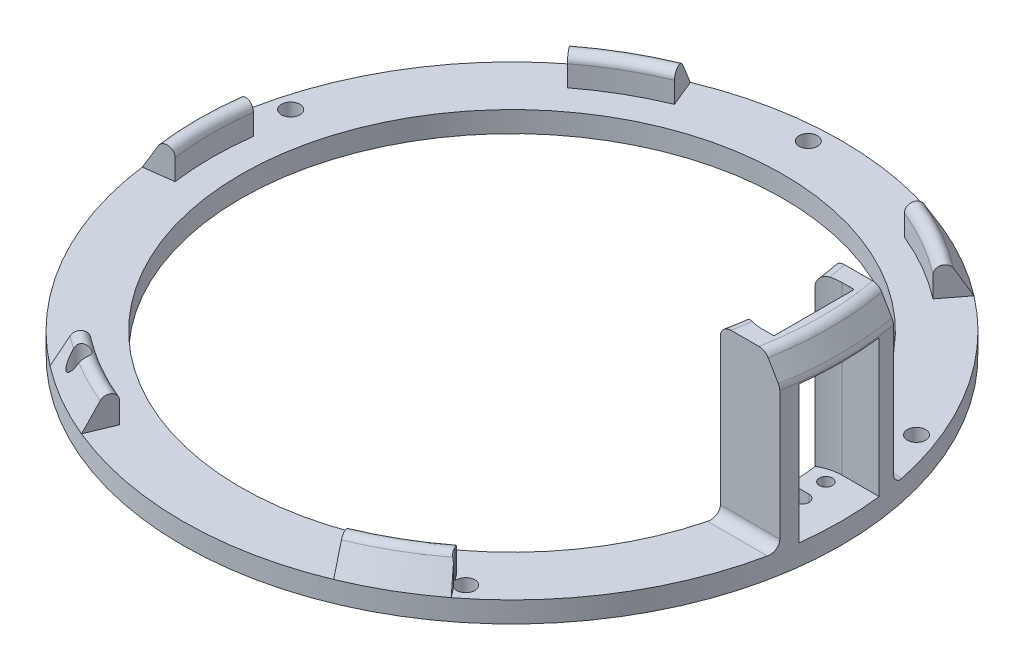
ISO-10303-21;
HEADER;
FILE_DESCRIPTION(('STEP AP214'),'2;1');
FILE_NAME('part.step','',(''),(''),'','','');
FILE_SCHEMA(('AUTOMOTIVE_DESIGN { 1 0 10303 214 1 1 1 1 }'));
ENDSEC;
DATA;
#1=APPLICATION_CONTEXT('core data for automotive mechanical design processes');
#2=APPLICATION_PROTOCOL_DEFINITION('international standard','automotive_design',2000,#1);
#3=PRODUCT_CONTEXT('',#1,'mechanical');
#4=PRODUCT('Part','Part','',(#3));
#5=PRODUCT_RELATED_PRODUCT_CATEGORY('part','',(#4));
#6=PRODUCT_DEFINITION_FORMATION('','',#4);
#7=PRODUCT_DEFINITION_CONTEXT('part definition',#1,'design');
#8=PRODUCT_DEFINITION('design','',#6,#7);
#9=PRODUCT_DEFINITION_SHAPE('','',#8);
#10=(LENGTH_UNIT() NAMED_UNIT(*) SI_UNIT(.MILLI.,.METRE.));
#11=(NAMED_UNIT(*) PLANE_ANGLE_UNIT() SI_UNIT($,.RADIAN.));
#12=(NAMED_UNIT(*) SI_UNIT($,.STERADIAN.) SOLID_ANGLE_UNIT());
#13=UNCERTAINTY_MEASURE_WITH_UNIT(LENGTH_MEASURE(1.E-05),#10,'distance_accuracy_value','');
#14=(GEOMETRIC_REPRESENTATION_CONTEXT(3) GLOBAL_UNCERTAINTY_ASSIGNED_CONTEXT((#13)) GLOBAL_UNIT_ASSIGNED_CONTEXT((#10,
#11,#12)) REPRESENTATION_CONTEXT('',''));
#15=CARTESIAN_POINT('',(0.,0.,0.));
#16=DIRECTION('',(0.,0.,1.));
#17=DIRECTION('',(1.,0.,0.));
#18=AXIS2_PLACEMENT_3D('',#15,#16,#17);
#19=CARTESIAN_POINT('',(57.1410177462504,12.7000000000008,74.4676241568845));
#20=DIRECTION('',(-0.79335334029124,0.,0.608761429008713));
#21=DIRECTION('',(0.608761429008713,0.,0.79335334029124));
#22=AXIS2_PLACEMENT_3D('',#19,#20,#21);
#23=PLANE('',#22);
#24=CARTESIAN_POINT('',(57.1410177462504,12.7000000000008,74.4676241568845));
#25=DIRECTION('',(0.79335334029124,0.,-0.608761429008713));
#26=DIRECTION('',(0.608761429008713,0.,0.79335334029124));
#27=AXIS2_PLACEMENT_3D('',#24,#25,#26);
#28=CIRCLE('',#27,2.42438598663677);
#29=CARTESIAN_POINT('',(55.6651450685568,12.7000000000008,72.5442294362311));
#30=VERTEX_POINT('',#29);
#31=CARTESIAN_POINT('',(57.228870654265,15.1200869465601,74.582116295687));
#32=VERTEX_POINT('',#31);
#33=EDGE_CURVE('E937',#30,#32,#28,.T.);
#34=ORIENTED_EDGE('',*,*,#33,.T.);
#35=DIRECTION('',(0.,-1.,0.));
#36=VECTOR('',#35,1.);
#37=CARTESIAN_POINT('',(57.228870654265,0.,74.582116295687));
#38=LINE('',#37,#36);
#39=CARTESIAN_POINT('',(57.228870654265,6.34999999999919,74.582116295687));
#40=VERTEX_POINT('',#39);
#41=EDGE_CURVE('E68',#32,#40,#38,.T.);
#42=ORIENTED_EDGE('',*,*,#41,.T.);
#43=DIRECTION('',(-0.608761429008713,1.83033815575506E-13,-0.79335334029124));
#44=VECTOR('',#43,1.);
#45=CARTESIAN_POINT('',(61.0770341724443,6.34999999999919,79.5971406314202));
#46=LINE('',#45,#44);
#47=CARTESIAN_POINT('',(55.6651450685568,6.35000000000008,72.5442294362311));
#48=VERTEX_POINT('',#47);
#49=EDGE_CURVE('E934',#40,#48,#46,.T.);
#50=ORIENTED_EDGE('',*,*,#49,.T.);
#51=DIRECTION('',(0.,1.,0.));
#52=VECTOR('',#51,1.);
#53=CARTESIAN_POINT('',(55.6651450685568,6.35000000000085,72.5442294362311));
#54=LINE('',#53,#52);
#55=EDGE_CURVE('E933',#48,#30,#54,.T.);
#56=ORIENTED_EDGE('',*,*,#55,.T.);
#57=EDGE_LOOP('',(#34,#42,#50,#56));
#58=FACE_BOUND('',#57,.T.);
#59=ADVANCED_FACE('F50',(#58),#23,.F.);
#60=CARTESIAN_POINT('',(0.,6.34999999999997,0.));
#61=DIRECTION('',(0.,1.,0.));
#62=DIRECTION('',(0.,0.,1.));
#63=AXIS2_PLACEMENT_3D('',#60,#61,#62);
#64=PLANE('',#63);
#65=CARTESIAN_POINT('',(-92.0780385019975,6.34999999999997,-24.6722360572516));
#66=DIRECTION('',(0.,1.,0.));
#67=DIRECTION('',(0.,0.,1.));
#68=AXIS2_PLACEMENT_3D('',#65,#66,#67);
#69=CIRCLE('',#68,2.8067);
#70=CARTESIAN_POINT('',(-92.0780385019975,6.34999999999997,-21.8655360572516));
#71=VERTEX_POINT('',#70);
#72=EDGE_CURVE('E55',#71,#71,#69,.T.);
#73=ORIENTED_EDGE('',*,*,#72,.F.);
#74=EDGE_LOOP('',(#73));
#75=FACE_BOUND('',#74,.T.);
#76=CARTESIAN_POINT('',(-4.9889878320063,6.34999999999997,-95.195558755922));
#77=DIRECTION('',(0.,1.,0.));
#78=DIRECTION('',(0.,0.,1.));
#79=AXIS2_PLACEMENT_3D('',#76,#77,#78);
#80=CIRCLE('',#79,2.80669999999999);
#81=CARTESIAN_POINT('',(-4.9889878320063,6.34999999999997,-92.388858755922));
#82=VERTEX_POINT('',#81);
#83=EDGE_CURVE('E1183',#82,#82,#80,.T.);
#84=ORIENTED_EDGE('',*,*,#83,.F.);
#85=EDGE_LOOP('',(#84));
#86=FACE_BOUND('',#85,.T.);
#87=CARTESIAN_POINT('',(88.9946744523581,6.35000000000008,-34.1618548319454));
#88=DIRECTION('',(0.,1.,0.));
#89=DIRECTION('',(0.,0.,1.));
#90=AXIS2_PLACEMENT_3D('',#87,#88,#89);
#91=CIRCLE('',#90,2.8067);
#92=CARTESIAN_POINT('',(88.9946744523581,6.35000000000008,-31.3551548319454));
#93=VERTEX_POINT('',#92);
#94=EDGE_CURVE('E1182',#93,#93,#91,.T.);
#95=ORIENTED_EDGE('',*,*,#94,.F.);
#96=EDGE_LOOP('',(#95));
#97=FACE_BOUND('',#96,.T.);
#98=CARTESIAN_POINT('',(59.9907214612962,6.35000000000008,74.0823713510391));
#99=DIRECTION('',(0.,1.,0.));
#100=DIRECTION('',(0.,0.,1.));
#101=AXIS2_PLACEMENT_3D('',#98,#99,#100);
#102=CIRCLE('',#101,2.80669999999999);
#103=CARTESIAN_POINT('',(58.7931853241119,6.34999999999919,76.6207708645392));
#104=VERTEX_POINT('',#103);
#105=EDGE_CURVE('E1015',#104,#40,#102,.T.);
#106=ORIENTED_EDGE('',*,*,#105,.F.);
#107=CARTESIAN_POINT('',(61.0770341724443,6.34999999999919,79.5971406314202));
#108=VERTEX_POINT('',#107);
#109=EDGE_CURVE('E929',#108,#104,#46,.T.);
#110=ORIENTED_EDGE('',*,*,#109,.F.);
#111=CARTESIAN_POINT('',(0.,6.34999999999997,0.));
#112=DIRECTION('',(0.,1.,0.));
#113=DIRECTION('',(0.,0.,1.));
#114=AXIS2_PLACEMENT_3D('',#111,#112,#113);
#115=CIRCLE('',#114,100.33);
#116=CARTESIAN_POINT('',(98.2202158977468,6.35000000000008,20.4670000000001));
#117=VERTEX_POINT('',#116);
#118=EDGE_CURVE('E849',#108,#117,#115,.T.);
#119=ORIENTED_EDGE('',*,*,#118,.T.);
#120=DIRECTION('',(1.,0.,0.));
#121=VECTOR('',#120,1.);
#122=CARTESIAN_POINT('',(0.,6.35000000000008,20.4670000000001));
#123=LINE('',#122,#121);
#124=CARTESIAN_POINT('',(79.9725228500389,6.35000000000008,20.4670000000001));
#125=VERTEX_POINT('',#124);
#126=EDGE_CURVE('E696',#117,#125,#123,.F.);
#127=ORIENTED_EDGE('',*,*,#126,.T.);
#128=CARTESIAN_POINT('',(0.,6.34999999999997,0.));
#129=DIRECTION('',(0.,1.,0.));
#130=DIRECTION('',(0.,0.,1.));
#131=AXIS2_PLACEMENT_3D('',#128,#129,#130);
#132=CIRCLE('',#131,82.55);
#133=CARTESIAN_POINT('',(79.9725228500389,6.34999999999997,-20.4670000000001));
#134=VERTEX_POINT('',#133);
#135=EDGE_CURVE('E721',#134,#125,#132,.T.);
#136=ORIENTED_EDGE('',*,*,#135,.F.);
#137=DIRECTION('',(-1.,0.,0.));
#138=VECTOR('',#137,1.);
#139=CARTESIAN_POINT('',(0.,6.34999999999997,-20.4670000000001));
#140=LINE('',#139,#138);
#141=CARTESIAN_POINT('',(98.2202158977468,6.34999999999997,-20.4670000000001));
#142=VERTEX_POINT('',#141);
#143=EDGE_CURVE('E1136',#134,#142,#140,.F.);
#144=ORIENTED_EDGE('',*,*,#143,.T.);
#145=CARTESIAN_POINT('',(61.0770341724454,6.35000000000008,-79.5971406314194));
#146=VERTEX_POINT('',#145);
#147=EDGE_CURVE('E698',#142,#146,#115,.T.);
#148=ORIENTED_EDGE('',*,*,#147,.T.);
#149=DIRECTION('',(-0.608761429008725,1.83033815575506E-13,0.793353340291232));
#150=VECTOR('',#149,1.);
#151=CARTESIAN_POINT('',(61.0770341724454,6.34999999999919,-79.5971406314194));
#152=LINE('',#151,#150);
#153=CARTESIAN_POINT('',(55.6651450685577,6.34999999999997,-72.5442294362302));
#154=VERTEX_POINT('',#153);
#155=EDGE_CURVE('E434',#146,#154,#152,.T.);
#156=ORIENTED_EDGE('',*,*,#155,.T.);
#157=CARTESIAN_POINT('',(0.,6.35000000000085,0.));
#158=DIRECTION('',(0.,-1.,0.));
#159=DIRECTION('',(0.866025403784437,0.,0.500000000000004));
#160=AXIS2_PLACEMENT_3D('',#157,#158,#159);
#161=CIRCLE('',#160,91.4400000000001);
#162=CARTESIAN_POINT('',(34.9925730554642,6.34999999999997,-84.479544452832));
#163=VERTEX_POINT('',#162);
#164=EDGE_CURVE('E465',#163,#154,#161,.T.);
#165=ORIENTED_EDGE('',*,*,#164,.F.);
#166=DIRECTION('',(-0.382683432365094,1.83033815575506E-13,0.923879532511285));
#167=VECTOR('',#166,1.);
#168=CARTESIAN_POINT('',(38.3946287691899,6.34999999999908,-92.6928334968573));
#169=LINE('',#168,#167);
#170=CARTESIAN_POINT('',(38.3946287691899,6.34999999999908,-92.6928334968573));
#171=VERTEX_POINT('',#170);
#172=EDGE_CURVE('E453',#171,#163,#169,.T.);
#173=ORIENTED_EDGE('',*,*,#172,.F.);
#174=CARTESIAN_POINT('',(-38.3946287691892,6.34999999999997,-92.6928334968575));
#175=VERTEX_POINT('',#174);
#176=EDGE_CURVE('E847',#171,#175,#115,.T.);
#177=ORIENTED_EDGE('',*,*,#176,.T.);
#178=DIRECTION('',(0.382683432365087,1.83033815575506E-13,0.923879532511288));
#179=VECTOR('',#178,1.);
#180=CARTESIAN_POINT('',(-38.3946287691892,6.34999999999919,-92.6928334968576));
#181=LINE('',#180,#179);
#182=CARTESIAN_POINT('',(-34.9925730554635,6.34999999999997,-84.479544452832));
#183=VERTEX_POINT('',#182);
#184=EDGE_CURVE('E478',#175,#183,#181,.T.);
#185=ORIENTED_EDGE('',*,*,#184,.T.);
#186=CARTESIAN_POINT('',(0.,6.35000000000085,0.));
#187=DIRECTION('',(0.,-1.,0.));
#188=DIRECTION('',(0.86602540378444,0.,-0.499999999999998));
#189=AXIS2_PLACEMENT_3D('',#186,#187,#188);
#190=CIRCLE('',#189,91.4400000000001);
#191=CARTESIAN_POINT('',(-55.6651450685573,6.34999999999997,-72.5442294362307));
#192=VERTEX_POINT('',#191);
#193=EDGE_CURVE('E501',#192,#183,#190,.T.);
#194=ORIENTED_EDGE('',*,*,#193,.F.);
#195=DIRECTION('',(0.608761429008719,1.83033815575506E-13,0.793353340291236));
#196=VECTOR('',#195,1.);
#197=CARTESIAN_POINT('',(-61.0770341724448,6.34999999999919,-79.5971406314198));
#198=LINE('',#197,#196);
#199=CARTESIAN_POINT('',(-61.0770341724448,6.34999999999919,-79.5971406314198));
#200=VERTEX_POINT('',#199);
#201=EDGE_CURVE('E489',#200,#192,#198,.T.);
#202=ORIENTED_EDGE('',*,*,#201,.F.);
#203=CARTESIAN_POINT('',(-99.4716629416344,6.34999999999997,-13.0956928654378));
#204=VERTEX_POINT('',#203);
#205=EDGE_CURVE('E830',#200,#204,#115,.T.);
#206=ORIENTED_EDGE('',*,*,#205,.T.);
#207=DIRECTION('',(0.99144486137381,1.83033815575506E-13,0.130526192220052));
#208=VECTOR('',#207,1.);
#209=CARTESIAN_POINT('',(-99.4716629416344,6.34999999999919,-13.0956928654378));
#210=LINE('',#209,#208);
#211=CARTESIAN_POINT('',(-90.6577181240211,6.34999999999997,-11.9353150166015));
#212=VERTEX_POINT('',#211);
#213=EDGE_CURVE('E512',#204,#212,#210,.T.);
#214=ORIENTED_EDGE('',*,*,#213,.T.);
#215=CARTESIAN_POINT('',(0.,6.35000000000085,0.));
#216=DIRECTION('',(0.,-1.,0.));
#217=DIRECTION('',(0.,0.,-1.));
#218=AXIS2_PLACEMENT_3D('',#215,#216,#217);
#219=CIRCLE('',#218,91.4400000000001);
#220=CARTESIAN_POINT('',(-90.6577181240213,6.34999999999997,11.9353150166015));
#221=VERTEX_POINT('',#220);
#222=EDGE_CURVE('E538',#221,#212,#219,.T.);
#223=ORIENTED_EDGE('',*,*,#222,.F.);
#224=DIRECTION('',(0.99144486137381,1.83033815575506E-13,-0.130526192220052));
#225=VECTOR('',#224,1.);
#226=CARTESIAN_POINT('',(-99.4716629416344,6.34999999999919,13.0956928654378));
#227=LINE('',#226,#225);
#228=CARTESIAN_POINT('',(-99.4716629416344,6.34999999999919,13.0956928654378));
#229=VERTEX_POINT('',#228);
#230=EDGE_CURVE('E526',#229,#221,#227,.T.);
#231=ORIENTED_EDGE('',*,*,#230,.F.);
#232=CARTESIAN_POINT('',(-61.0770341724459,6.34999999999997,79.5971406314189));
#233=VERTEX_POINT('',#232);
#234=EDGE_CURVE('E827',#229,#233,#115,.T.);
#235=ORIENTED_EDGE('',*,*,#234,.T.);
#236=DIRECTION('',(0.60876142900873,1.83033815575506E-13,-0.793353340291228));
#237=VECTOR('',#236,1.);
#238=CARTESIAN_POINT('',(-61.0770341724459,6.34999999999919,79.5971406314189));
#239=LINE('',#238,#237);
#240=CARTESIAN_POINT('',(-55.6651450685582,6.35000000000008,72.5442294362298));
#241=VERTEX_POINT('',#240);
#242=EDGE_CURVE('E1000',#233,#241,#239,.T.);
#243=ORIENTED_EDGE('',*,*,#242,.T.);
#244=CARTESIAN_POINT('',(0.,6.35000000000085,0.));
#245=DIRECTION('',(0.,-1.,0.));
#246=DIRECTION('',(-0.866025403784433,0.,-0.50000000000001));
#247=AXIS2_PLACEMENT_3D('',#244,#245,#246);
#248=CIRCLE('',#247,91.4400000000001);
#249=CARTESIAN_POINT('',(-34.9925730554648,6.35000000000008,84.4795444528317));
#250=VERTEX_POINT('',#249);
#251=EDGE_CURVE('E973',#250,#241,#248,.T.);
#252=ORIENTED_EDGE('',*,*,#251,.F.);
#253=DIRECTION('',(0.3826834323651,1.83033815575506E-13,-0.923879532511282));
#254=VECTOR('',#253,1.);
#255=CARTESIAN_POINT('',(-38.3946287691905,6.3499999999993,92.692833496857));
#256=LINE('',#255,#254);
#257=CARTESIAN_POINT('',(-38.3946287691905,6.3499999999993,92.692833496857));
#258=VERTEX_POINT('',#257);
#259=EDGE_CURVE('E987',#258,#250,#256,.T.);
#260=ORIENTED_EDGE('',*,*,#259,.F.);
#261=CARTESIAN_POINT('',(38.3946287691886,6.34999999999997,92.6928334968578));
#262=VERTEX_POINT('',#261);
#263=EDGE_CURVE('E831',#258,#262,#115,.T.);
#264=ORIENTED_EDGE('',*,*,#263,.T.);
#265=DIRECTION('',(-0.382683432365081,1.83033815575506E-13,-0.92387953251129));
#266=VECTOR('',#265,1.);
#267=CARTESIAN_POINT('',(38.3946287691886,6.34999999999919,92.6928334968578));
#268=LINE('',#267,#266);
#269=CARTESIAN_POINT('',(34.992573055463,6.34999999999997,84.4795444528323));
#270=VERTEX_POINT('',#269);
#271=EDGE_CURVE('E956',#262,#270,#268,.T.);
#272=ORIENTED_EDGE('',*,*,#271,.T.);
#273=CARTESIAN_POINT('',(0.,6.35000000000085,0.));
#274=DIRECTION('',(0.,-1.,0.));
#275=DIRECTION('',(-0.866025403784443,0.,0.499999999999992));
#276=AXIS2_PLACEMENT_3D('',#273,#274,#275);
#277=CIRCLE('',#276,91.4400000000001);
#278=EDGE_CURVE('E436',#48,#270,#277,.T.);
#279=ORIENTED_EDGE('',*,*,#278,.F.);
#280=ORIENTED_EDGE('',*,*,#49,.F.);
#281=EDGE_LOOP('',(#106,#110,#119,#127,#136,#144,#148,#156,#165,#173,#177,#185,#194,#202,#206,
#214,#223,#231,#235,#243,#252,#260,#264,#272,#279,#280));
#282=FACE_BOUND('',#281,.T.);
#283=ADVANCED_FACE('F908',(#75,#86,#97,#282),#64,.T.);
#284=CARTESIAN_POINT('',(87.565,6.34999999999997,7.999984));
#285=DIRECTION('',(0.,-1.,0.));
#286=DIRECTION('',(0.,0.,-1.));
#287=AXIS2_PLACEMENT_3D('',#284,#285,#286);
#288=CIRCLE('',#287,1.99389999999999);
#289=CARTESIAN_POINT('',(87.565,6.34999999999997,6.00608400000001));
#290=VERTEX_POINT('',#289);
#291=EDGE_CURVE('E1556',#290,#290,#288,.T.);
#292=ORIENTED_EDGE('',*,*,#291,.T.);
#293=EDGE_LOOP('',(#292));
#294=FACE_BOUND('',#293,.T.);
#295=CARTESIAN_POINT('',(87.565,6.34999999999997,-7.999984));
#296=DIRECTION('',(0.,-1.,0.));
#297=DIRECTION('',(0.,0.,-1.));
#298=AXIS2_PLACEMENT_3D('',#295,#296,#297);
#299=CIRCLE('',#298,1.99389999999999);
#300=CARTESIAN_POINT('',(87.565,6.34999999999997,-9.99388399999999));
#301=VERTEX_POINT('',#300);
#302=EDGE_CURVE('E1559',#301,#301,#299,.T.);
#303=ORIENTED_EDGE('',*,*,#302,.T.);
#304=EDGE_LOOP('',(#303));
#305=FACE_BOUND('',#304,.T.);
#306=DIRECTION('',(1.,0.,0.));
#307=VECTOR('',#306,1.);
#308=CARTESIAN_POINT('',(99.5840145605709,6.34999999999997,-12.2120000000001));
#309=LINE('',#308,#307);
#310=CARTESIAN_POINT('',(88.265,6.34999999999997,-12.2120000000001));
#311=VERTEX_POINT('',#310);
#312=CARTESIAN_POINT('',(99.5840145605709,6.34999999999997,-12.2120000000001));
#313=VERTEX_POINT('',#312);
#314=EDGE_CURVE('E579',#311,#313,#309,.T.);
#315=ORIENTED_EDGE('',*,*,#314,.F.);
#316=CARTESIAN_POINT('',(88.265,6.34999999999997,0.));
#317=DIRECTION('',(0.,-1.,0.));
#318=DIRECTION('',(0.,0.,-1.));
#319=AXIS2_PLACEMENT_3D('',#316,#317,#318);
#320=CIRCLE('',#319,12.2120000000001);
#321=CARTESIAN_POINT('',(81.8902157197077,6.34999999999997,-10.4160966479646));
#322=VERTEX_POINT('',#321);
#323=EDGE_CURVE('E571',#322,#311,#320,.T.);
#324=ORIENTED_EDGE('',*,*,#323,.F.);
#325=CARTESIAN_POINT('',(82.5211339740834,6.34999999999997,-2.1828760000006));
#326=VERTEX_POINT('',#325);
#327=EDGE_CURVE('E1160',#326,#322,#132,.T.);
#328=ORIENTED_EDGE('',*,*,#327,.F.);
#329=DIRECTION('',(-1.,0.,0.));
#330=VECTOR('',#329,1.);
#331=CARTESIAN_POINT('',(88.265,6.34999999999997,-2.1828760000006));
#332=LINE('',#331,#330);
#333=CARTESIAN_POINT('',(88.265,6.34999999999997,-2.1828760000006));
#334=VERTEX_POINT('',#333);
#335=EDGE_CURVE('E1112',#334,#326,#332,.T.);
#336=ORIENTED_EDGE('',*,*,#335,.F.);
#337=CARTESIAN_POINT('',(88.2650000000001,6.34999999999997,6.06147934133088E-13));
#338=DIRECTION('',(0.,-1.,0.));
#339=DIRECTION('',(0.,0.,-1.));
#340=AXIS2_PLACEMENT_3D('',#337,#338,#339);
#341=CIRCLE('',#340,2.182876);
#342=CARTESIAN_POINT('',(88.2650000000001,6.34999999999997,2.18287600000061));
#343=VERTEX_POINT('',#342);
#344=EDGE_CURVE('E1190',#334,#343,#341,.T.);
#345=ORIENTED_EDGE('',*,*,#344,.T.);
#346=DIRECTION('',(1.,0.,0.));
#347=VECTOR('',#346,1.);
#348=CARTESIAN_POINT('',(88.2650000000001,6.34999999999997,2.18287600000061));
#349=LINE('',#348,#347);
#350=CARTESIAN_POINT('',(82.5211339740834,6.34999999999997,2.18287600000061));
#351=VERTEX_POINT('',#350);
#352=EDGE_CURVE('E1115',#351,#343,#349,.T.);
#353=ORIENTED_EDGE('',*,*,#352,.F.);
#354=CARTESIAN_POINT('',(81.8902157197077,6.35000000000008,10.4160966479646));
#355=VERTEX_POINT('',#354);
#356=EDGE_CURVE('E836',#355,#351,#132,.T.);
#357=ORIENTED_EDGE('',*,*,#356,.F.);
#358=CARTESIAN_POINT('',(88.265,6.34999999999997,0.));
#359=DIRECTION('',(0.,-1.,0.));
#360=DIRECTION('',(0.,0.,1.));
#361=AXIS2_PLACEMENT_3D('',#358,#359,#360);
#362=CIRCLE('',#361,12.2120000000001);
#363=CARTESIAN_POINT('',(88.265,6.35000000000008,12.2120000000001));
#364=VERTEX_POINT('',#363);
#365=EDGE_CURVE('E615',#364,#355,#362,.T.);
#366=ORIENTED_EDGE('',*,*,#365,.F.);
#367=DIRECTION('',(-1.,0.,0.));
#368=VECTOR('',#367,1.);
#369=CARTESIAN_POINT('',(99.5840145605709,6.34999999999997,12.2120000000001));
#370=LINE('',#369,#368);
#371=CARTESIAN_POINT('',(99.5840145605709,6.34999999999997,12.2120000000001));
#372=VERTEX_POINT('',#371);
#373=EDGE_CURVE('E610',#372,#364,#370,.T.);
#374=ORIENTED_EDGE('',*,*,#373,.F.);
#375=EDGE_CURVE('E838',#372,#313,#115,.T.);
#376=ORIENTED_EDGE('',*,*,#375,.T.);
#377=EDGE_LOOP('',(#315,#324,#328,#336,#345,#353,#357,#366,#374,#376));
#378=FACE_BOUND('',#377,.T.);
#379=ADVANCED_FACE('F813',(#294,#305,#378),#64,.T.);
#380=CARTESIAN_POINT('',(0.,0.,0.));
#381=DIRECTION('',(0.,1.,0.));
#382=DIRECTION('',(0.,0.,1.));
#383=AXIS2_PLACEMENT_3D('',#380,#381,#382);
#384=PLANE('',#383);
#385=CARTESIAN_POINT('',(-92.0780385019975,0.,-24.6722360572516));
#386=DIRECTION('',(0.,-1.,0.));
#387=DIRECTION('',(0.,0.,-1.));
#388=AXIS2_PLACEMENT_3D('',#385,#386,#387);
#389=CIRCLE('',#388,2.8067);
#390=CARTESIAN_POINT('',(-92.0780385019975,0.,-27.4789360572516));
#391=VERTEX_POINT('',#390);
#392=EDGE_CURVE('E1496',#391,#391,#389,.T.);
#393=ORIENTED_EDGE('',*,*,#392,.F.);
#394=EDGE_LOOP('',(#393));
#395=FACE_BOUND('',#394,.T.);
#396=CARTESIAN_POINT('',(-4.9889878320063,0.,-95.195558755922));
#397=DIRECTION('',(0.,-1.,0.));
#398=DIRECTION('',(0.,0.,-1.));
#399=AXIS2_PLACEMENT_3D('',#396,#397,#398);
#400=CIRCLE('',#399,2.80669999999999);
#401=CARTESIAN_POINT('',(-4.9889878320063,0.,-98.002258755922));
#402=VERTEX_POINT('',#401);
#403=EDGE_CURVE('E1197',#402,#402,#400,.T.);
#404=ORIENTED_EDGE('',*,*,#403,.F.);
#405=EDGE_LOOP('',(#404));
#406=FACE_BOUND('',#405,.T.);
#407=CARTESIAN_POINT('',(88.9946744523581,1.11022302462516E-13,-34.1618548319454));
#408=DIRECTION('',(0.,-1.,0.));
#409=DIRECTION('',(0.,0.,-1.));
#410=AXIS2_PLACEMENT_3D('',#407,#408,#409);
#411=CIRCLE('',#410,2.8067);
#412=CARTESIAN_POINT('',(88.9946744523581,1.11022302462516E-13,-36.9685548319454));
#413=VERTEX_POINT('',#412);
#414=EDGE_CURVE('E1179',#413,#413,#411,.T.);
#415=ORIENTED_EDGE('',*,*,#414,.F.);
#416=EDGE_LOOP('',(#415));
#417=FACE_BOUND('',#416,.T.);
#418=CARTESIAN_POINT('',(59.9907214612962,0.,74.0823713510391));
#419=DIRECTION('',(0.,-1.,0.));
#420=DIRECTION('',(0.,0.,-1.));
#421=AXIS2_PLACEMENT_3D('',#418,#419,#420);
#422=CIRCLE('',#421,2.80669999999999);
#423=CARTESIAN_POINT('',(59.9907214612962,0.,71.2756713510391));
#424=VERTEX_POINT('',#423);
#425=EDGE_CURVE('E420',#424,#424,#422,.T.);
#426=ORIENTED_EDGE('',*,*,#425,.F.);
#427=EDGE_LOOP('',(#426));
#428=FACE_BOUND('',#427,.T.);
#429=CARTESIAN_POINT('',(-51.918369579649,1.11022302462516E-13,79.9472782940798));
#430=DIRECTION('',(0.,-1.,0.));
#431=DIRECTION('',(0.,0.,-1.));
#432=AXIS2_PLACEMENT_3D('',#429,#430,#431);
#433=CIRCLE('',#432,2.80669999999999);
#434=CARTESIAN_POINT('',(-51.918369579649,1.11022302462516E-13,77.1405782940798));
#435=VERTEX_POINT('',#434);
#436=EDGE_CURVE('E888',#435,#435,#433,.T.);
#437=ORIENTED_EDGE('',*,*,#436,.F.);
#438=EDGE_LOOP('',(#437));
#439=FACE_BOUND('',#438,.T.);
#440=CARTESIAN_POINT('',(87.565,0.,7.999984));
#441=DIRECTION('',(0.,-1.,0.));
#442=DIRECTION('',(0.,0.,-1.));
#443=AXIS2_PLACEMENT_3D('',#440,#441,#442);
#444=CIRCLE('',#443,1.99389999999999);
#445=CARTESIAN_POINT('',(87.565,0.,6.00608400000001));
#446=VERTEX_POINT('',#445);
#447=EDGE_CURVE('E1226',#446,#446,#444,.T.);
#448=ORIENTED_EDGE('',*,*,#447,.F.);
#449=EDGE_LOOP('',(#448));
#450=FACE_BOUND('',#449,.T.);
#451=CARTESIAN_POINT('',(87.565,0.,-7.999984));
#452=DIRECTION('',(0.,-1.,0.));
#453=DIRECTION('',(0.,0.,-1.));
#454=AXIS2_PLACEMENT_3D('',#451,#452,#453);
#455=CIRCLE('',#454,1.99389999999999);
#456=CARTESIAN_POINT('',(87.565,0.,-9.99388399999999));
#457=VERTEX_POINT('',#456);
#458=EDGE_CURVE('E1230',#457,#457,#455,.T.);
#459=ORIENTED_EDGE('',*,*,#458,.F.);
#460=EDGE_LOOP('',(#459));
#461=FACE_BOUND('',#460,.T.);
#462=CARTESIAN_POINT('',(0.,0.,0.));
#463=DIRECTION('',(0.,1.,0.));
#464=DIRECTION('',(0.,0.,1.));
#465=AXIS2_PLACEMENT_3D('',#462,#463,#464);
#466=CIRCLE('',#465,82.55);
#467=CARTESIAN_POINT('',(82.5211339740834,0.,-2.1828760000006));
#468=VERTEX_POINT('',#467);
#469=CARTESIAN_POINT('',(82.5211339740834,0.,2.18287600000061));
#470=VERTEX_POINT('',#469);
#471=EDGE_CURVE('E1188',#468,#470,#466,.T.);
#472=ORIENTED_EDGE('',*,*,#471,.T.);
#473=DIRECTION('',(1.,0.,0.));
#474=VECTOR('',#473,1.);
#475=CARTESIAN_POINT('',(88.2650000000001,0.,2.18287600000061));
#476=LINE('',#475,#474);
#477=CARTESIAN_POINT('',(88.2650000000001,0.,2.18287600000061));
#478=VERTEX_POINT('',#477);
#479=EDGE_CURVE('E1615',#470,#478,#476,.T.);
#480=ORIENTED_EDGE('',*,*,#479,.T.);
#481=CARTESIAN_POINT('',(88.2650000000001,0.,6.06147934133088E-13));
#482=DIRECTION('',(0.,-1.,0.));
#483=DIRECTION('',(0.,0.,-1.));
#484=AXIS2_PLACEMENT_3D('',#481,#482,#483);
#485=CIRCLE('',#484,2.18287599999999);
#486=CARTESIAN_POINT('',(88.265,0.,-2.18287599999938));
#487=VERTEX_POINT('',#486);
#488=EDGE_CURVE('E1604',#487,#478,#485,.T.);
#489=ORIENTED_EDGE('',*,*,#488,.F.);
#490=DIRECTION('',(-1.,0.,0.));
#491=VECTOR('',#490,1.);
#492=CARTESIAN_POINT('',(88.265,0.,-2.1828760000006));
#493=LINE('',#492,#491);
#494=EDGE_CURVE('E1617',#487,#468,#493,.T.);
#495=ORIENTED_EDGE('',*,*,#494,.T.);
#496=EDGE_LOOP('',(#472,#480,#489,#495));
#497=FACE_BOUND('',#496,.T.);
#498=CARTESIAN_POINT('',(0.,0.,0.));
#499=DIRECTION('',(0.,1.,0.));
#500=DIRECTION('',(0.,0.,1.));
#501=AXIS2_PLACEMENT_3D('',#498,#499,#500);
#502=CIRCLE('',#501,100.33);
#503=CARTESIAN_POINT('',(0.,0.,100.33));
#504=VERTEX_POINT('',#503);
#505=EDGE_CURVE('E850',#504,#504,#502,.T.);
#506=ORIENTED_EDGE('',*,*,#505,.F.);
#507=EDGE_LOOP('',(#506));
#508=FACE_BOUND('',#507,.T.);
#509=ADVANCED_FACE('F1215',(#395,#406,#417,#428,#439,#450,#461,#497,#508),#384,.F.);
#510=CARTESIAN_POINT('',(0.,6.34999999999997,0.));
#511=DIRECTION('',(0.,-1.,0.));
#512=DIRECTION('',(0.,0.,-1.));
#513=AXIS2_PLACEMENT_3D('',#510,#511,#512);
#514=CYLINDRICAL_SURFACE('',#513,100.33);
#515=DIRECTION('',(0.,-1.,0.));
#516=VECTOR('',#515,1.);
#517=CARTESIAN_POINT('',(99.5840145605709,57.15,12.2120000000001));
#518=LINE('',#517,#516);
#519=CARTESIAN_POINT('',(99.5840145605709,48.26,12.2120000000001));
#520=VERTEX_POINT('',#519);
#521=EDGE_CURVE('E637',#520,#372,#518,.T.);
#522=ORIENTED_EDGE('',*,*,#521,.F.);
#523=CARTESIAN_POINT('',(0.,48.26,0.));
#524=DIRECTION('',(0.,1.,0.));
#525=DIRECTION('',(0.,0.,1.));
#526=AXIS2_PLACEMENT_3D('',#523,#524,#525);
#527=CIRCLE('',#526,100.33);
#528=CARTESIAN_POINT('',(99.584014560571,48.26,-12.2120000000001));
#529=VERTEX_POINT('',#528);
#530=EDGE_CURVE('E549',#520,#529,#527,.T.);
#531=ORIENTED_EDGE('',*,*,#530,.T.);
#532=DIRECTION('',(0.,-1.,0.));
#533=VECTOR('',#532,1.);
#534=CARTESIAN_POINT('',(99.5840145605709,57.1499999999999,-12.2120000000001));
#535=LINE('',#534,#533);
#536=EDGE_CURVE('E600',#529,#313,#535,.T.);
#537=ORIENTED_EDGE('',*,*,#536,.T.);
#538=ORIENTED_EDGE('',*,*,#375,.F.);
#539=EDGE_LOOP('',(#522,#531,#537,#538));
#540=FACE_BOUND('',#539,.T.);
#541=DIRECTION('',(0.,-1.,0.));
#542=VECTOR('',#541,1.);
#543=CARTESIAN_POINT('',(98.8286174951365,57.1499999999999,-17.2920000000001));
#544=LINE('',#543,#542);
#545=CARTESIAN_POINT('',(98.8286174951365,48.6792613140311,-17.2920000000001));
#546=VERTEX_POINT('',#545);
#547=CARTESIAN_POINT('',(98.8286174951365,9.52500000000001,-17.2920000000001));
#548=VERTEX_POINT('',#547);
#549=EDGE_CURVE('E596',#546,#548,#544,.T.);
#550=ORIENTED_EDGE('',*,*,#549,.F.);
#551=CARTESIAN_POINT('',(0.,48.6792613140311,0.));
#552=DIRECTION('',(0.,1.,0.));
#553=DIRECTION('',(0.,0.,1.));
#554=AXIS2_PLACEMENT_3D('',#551,#552,#553);
#555=CIRCLE('',#554,100.33);
#556=CARTESIAN_POINT('',(98.8286174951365,48.6792613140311,17.2920000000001));
#557=VERTEX_POINT('',#556);
#558=EDGE_CURVE('E782',#546,#557,#555,.F.);
#559=ORIENTED_EDGE('',*,*,#558,.T.);
#560=DIRECTION('',(0.,-1.,0.));
#561=VECTOR('',#560,1.);
#562=CARTESIAN_POINT('',(98.8286174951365,57.15,17.2920000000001));
#563=LINE('',#562,#561);
#564=CARTESIAN_POINT('',(98.8286174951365,9.52500000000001,17.2920000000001));
#565=VERTEX_POINT('',#564);
#566=EDGE_CURVE('E623',#557,#565,#563,.T.);
#567=ORIENTED_EDGE('',*,*,#566,.T.);
#568=CARTESIAN_POINT('',(98.8286174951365,9.52500000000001,17.2920000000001));
#569=CARTESIAN_POINT('',(98.8286182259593,9.43672191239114,17.2919907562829));
#570=CARTESIAN_POINT('',(98.8279732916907,9.34844820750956,17.2956816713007));
#571=CARTESIAN_POINT('',(98.825398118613,9.1725387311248,17.3103925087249));
#572=CARTESIAN_POINT('',(98.8234679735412,9.08490291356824,17.321411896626));
#573=CARTESIAN_POINT('',(98.8183312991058,8.91098338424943,17.350691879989));
#574=CARTESIAN_POINT('',(98.8151262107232,8.82469825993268,17.3689443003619));
#575=CARTESIAN_POINT('',(98.8074550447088,8.65401829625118,17.4125303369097));
#576=CARTESIAN_POINT('',(98.8029889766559,8.56962344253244,17.4378638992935));
#577=CARTESIAN_POINT('',(98.7877167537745,8.32010668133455,17.5242515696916));
#578=CARTESIAN_POINT('',(98.77503384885,8.1585597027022,17.5957084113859));
#579=CARTESIAN_POINT('',(98.7448922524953,7.84995597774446,17.764076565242));
#580=CARTESIAN_POINT('',(98.7274339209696,7.70289814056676,17.860985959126));
#581=CARTESIAN_POINT('',(98.6879252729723,7.42632991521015,18.0780117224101));
#582=CARTESIAN_POINT('',(98.6658490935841,7.29692544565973,18.1982585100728));
#583=CARTESIAN_POINT('',(98.6175770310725,7.06011121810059,18.458055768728));
#584=CARTESIAN_POINT('',(98.5913803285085,6.95270584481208,18.5976100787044));
#585=CARTESIAN_POINT('',(98.5349882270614,6.76125259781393,18.8941279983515));
#586=CARTESIAN_POINT('',(98.5047402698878,6.67756668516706,19.0513150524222));
#587=CARTESIAN_POINT('',(98.4412099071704,6.53774560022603,19.3769077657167));
#588=CARTESIAN_POINT('',(98.4079283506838,6.48160274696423,19.5453102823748));
#589=CARTESIAN_POINT('',(98.3488970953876,6.40998509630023,19.8398353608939));
#590=CARTESIAN_POINT('',(98.3236868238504,6.38749339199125,19.9644103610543));
#591=CARTESIAN_POINT('',(98.2724753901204,6.35750171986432,20.214994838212));
#592=CARTESIAN_POINT('',(98.2464754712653,6.34997931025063,20.3410018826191));
#593=CARTESIAN_POINT('',(98.2202158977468,6.35000000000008,20.4670000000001));
#594=B_SPLINE_CURVE_WITH_KNOTS('',3,(#568,#569,#570,#571,#572,#573,#574,#575,#576,#577,#578,
#579,#580,#581,#582,#583,#584,#585,#586,#587,#588,#589,#590,#591,#592,#593),.UNSPECIFIED.,.F.,
.F.,(4,2,2,2,2,2,2,2,2,2,2,2,4),(0.,0.264746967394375,0.529474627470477,0.793903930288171,
1.05833122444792,1.58690666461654,2.11544227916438,2.64702133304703,3.17870623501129,
3.71811453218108,4.25737231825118,4.6437602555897,5.02956848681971),.UNSPECIFIED.);
#595=EDGE_CURVE('E823',#565,#117,#594,.T.);
#596=ORIENTED_EDGE('',*,*,#595,.T.);
#597=ORIENTED_EDGE('',*,*,#118,.F.);
#598=CARTESIAN_POINT('',(0.,6.34999999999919,0.));
#599=DIRECTION('',(0.,-1.,0.));
#600=DIRECTION('',(-0.866025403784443,0.,0.499999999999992));
#601=AXIS2_PLACEMENT_3D('',#598,#599,#600);
#602=CIRCLE('',#601,100.33);
#603=EDGE_CURVE('E943',#108,#262,#602,.T.);
#604=ORIENTED_EDGE('',*,*,#603,.T.);
#605=ORIENTED_EDGE('',*,*,#263,.F.);
#606=CARTESIAN_POINT('',(0.,6.34999999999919,0.));
#607=DIRECTION('',(0.,-1.,0.));
#608=DIRECTION('',(-0.866025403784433,0.,-0.50000000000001));
#609=AXIS2_PLACEMENT_3D('',#606,#607,#608);
#610=CIRCLE('',#609,100.33);
#611=EDGE_CURVE('E976',#258,#233,#610,.T.);
#612=ORIENTED_EDGE('',*,*,#611,.T.);
#613=ORIENTED_EDGE('',*,*,#234,.F.);
#614=CARTESIAN_POINT('',(0.,6.34999999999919,0.));
#615=DIRECTION('',(0.,-1.,0.));
#616=DIRECTION('',(0.,0.,-1.));
#617=AXIS2_PLACEMENT_3D('',#614,#615,#616);
#618=CIRCLE('',#617,100.33);
#619=EDGE_CURVE('E535',#229,#204,#618,.T.);
#620=ORIENTED_EDGE('',*,*,#619,.T.);
#621=ORIENTED_EDGE('',*,*,#205,.F.);
#622=CARTESIAN_POINT('',(0.,6.34999999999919,0.));
#623=DIRECTION('',(0.,-1.,0.));
#624=DIRECTION('',(0.86602540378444,0.,-0.499999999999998));
#625=AXIS2_PLACEMENT_3D('',#622,#623,#624);
#626=CIRCLE('',#625,100.33);
#627=EDGE_CURVE('E498',#200,#175,#626,.T.);
#628=ORIENTED_EDGE('',*,*,#627,.T.);
#629=ORIENTED_EDGE('',*,*,#176,.F.);
#630=CARTESIAN_POINT('',(0.,6.34999999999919,0.));
#631=DIRECTION('',(0.,-1.,0.));
#632=DIRECTION('',(0.866025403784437,0.,0.500000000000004));
#633=AXIS2_PLACEMENT_3D('',#630,#631,#632);
#634=CIRCLE('',#633,100.33);
#635=EDGE_CURVE('E462',#171,#146,#634,.T.);
#636=ORIENTED_EDGE('',*,*,#635,.T.);
#637=ORIENTED_EDGE('',*,*,#147,.F.);
#638=CARTESIAN_POINT('',(98.2202158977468,6.34999999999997,-20.4670000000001));
#639=CARTESIAN_POINT('',(98.2390339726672,6.34999240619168,-20.3766988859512));
#640=CARTESIAN_POINT('',(98.2577246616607,6.35385248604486,-20.2863736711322));
#641=CARTESIAN_POINT('',(98.2947297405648,6.36926295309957,-20.1063022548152));
#642=CARTESIAN_POINT('',(98.3130441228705,6.38081349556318,-20.0165560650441));
#643=CARTESIAN_POINT('',(98.3491731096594,6.41155883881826,-19.8382794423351));
#644=CARTESIAN_POINT('',(98.3669877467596,6.43075313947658,-19.749748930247));
#645=CARTESIAN_POINT('',(98.4019989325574,6.47665757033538,-19.5745626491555));
#646=CARTESIAN_POINT('',(98.4191954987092,6.5033674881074,-19.4879068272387));
#647=CARTESIAN_POINT('',(98.4697255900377,6.59462208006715,-19.2315430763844));
#648=CARTESIAN_POINT('',(98.5020016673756,6.6702934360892,-19.0654281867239));
#649=CARTESIAN_POINT('',(98.5628652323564,6.84924033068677,-18.7482443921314));
#650=CARTESIAN_POINT('',(98.5914542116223,6.95250465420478,-18.597169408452));
#651=CARTESIAN_POINT('',(98.6440344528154,7.18250613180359,-18.3162104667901));
#652=CARTESIAN_POINT('',(98.6680765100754,7.30894846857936,-18.1860951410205));
#653=CARTESIAN_POINT('',(98.7114941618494,7.58263533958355,-17.9489388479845));
#654=CARTESIAN_POINT('',(98.7308689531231,7.72988344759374,-17.8419018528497));
#655=CARTESIAN_POINT('',(98.7642908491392,8.0382271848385,-17.6559495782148));
#656=CARTESIAN_POINT('',(98.7784235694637,8.19904224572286,-17.5765837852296));
#657=CARTESIAN_POINT('',(98.8015723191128,8.53199987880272,-17.4459921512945));
#658=CARTESIAN_POINT('',(98.8105925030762,8.70413312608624,-17.3947434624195));
#659=CARTESIAN_POINT('',(98.8208599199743,8.98547716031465,-17.3362923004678));
#660=CARTESIAN_POINT('',(98.8237693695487,9.0927656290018,-17.3196916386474));
#661=CARTESIAN_POINT('',(98.827646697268,9.30835287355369,-17.2975486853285));
#662=CARTESIAN_POINT('',(98.8286174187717,9.41664993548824,-17.2919901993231));
#663=CARTESIAN_POINT('',(98.8286174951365,9.52500000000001,-17.2920000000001));
#664=B_SPLINE_CURVE_WITH_KNOTS('',3,(#638,#639,#640,#641,#642,#643,#644,#645,#646,#647,#648,
#649,#650,#651,#652,#653,#654,#655,#656,#657,#658,#659,#660,#661,#662,#663),.UNSPECIFIED.,.F.,
.F.,(4,2,2,2,2,2,2,2,2,2,2,2,4),(0.,0.276637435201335,0.55328045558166,0.82990537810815,
1.10652248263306,1.65972397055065,2.21270095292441,2.7590790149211,3.3055510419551,
3.84265759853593,4.37932705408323,4.70460417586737,5.02940389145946),.UNSPECIFIED.);
#665=EDGE_CURVE('E799',#142,#548,#664,.T.);
#666=ORIENTED_EDGE('',*,*,#665,.T.);
#667=EDGE_LOOP('',(#550,#559,#567,#596,#597,#604,#605,#612,#613,#620,#621,#628,#629,#636,#637,#666));
#668=FACE_BOUND('',#667,.T.);
#669=ORIENTED_EDGE('',*,*,#505,.T.);
#670=EDGE_LOOP('',(#669));
#671=FACE_BOUND('',#670,.T.);
#672=ADVANCED_FACE('F810',(#540,#668,#671),#514,.T.);
#673=CARTESIAN_POINT('',(0.,6.34999999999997,0.));
#674=DIRECTION('',(0.,-1.,0.));
#675=DIRECTION('',(0.,0.,-1.));
#676=AXIS2_PLACEMENT_3D('',#673,#674,#675);
#677=CYLINDRICAL_SURFACE('',#676,82.55);
#678=DIRECTION('',(0.,-1.,0.));
#679=VECTOR('',#678,1.);
#680=CARTESIAN_POINT('',(81.8902157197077,57.15,-10.4160966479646));
#681=LINE('',#680,#679);
#682=CARTESIAN_POINT('',(81.8902157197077,53.975,-10.4160966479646));
#683=VERTEX_POINT('',#682);
#684=EDGE_CURVE('E607',#683,#322,#681,.T.);
#685=ORIENTED_EDGE('',*,*,#684,.F.);
#686=CARTESIAN_POINT('',(0.,53.975,0.));
#687=DIRECTION('',(0.,1.,0.));
#688=DIRECTION('',(0.,0.,1.));
#689=AXIS2_PLACEMENT_3D('',#686,#687,#688);
#690=CIRCLE('',#689,82.55);
#691=CARTESIAN_POINT('',(80.718580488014,53.975,-17.2920000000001));
#692=VERTEX_POINT('',#691);
#693=EDGE_CURVE('E650',#683,#692,#690,.T.);
#694=ORIENTED_EDGE('',*,*,#693,.T.);
#695=DIRECTION('',(0.,-1.,0.));
#696=VECTOR('',#695,1.);
#697=CARTESIAN_POINT('',(80.718580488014,57.15,-17.2920000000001));
#698=LINE('',#697,#696);
#699=CARTESIAN_POINT('',(80.718580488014,9.52500000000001,-17.2920000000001));
#700=VERTEX_POINT('',#699);
#701=EDGE_CURVE('E587',#692,#700,#698,.T.);
#702=ORIENTED_EDGE('',*,*,#701,.T.);
#703=CARTESIAN_POINT('',(80.718580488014,9.52500000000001,-17.2920000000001));
#704=CARTESIAN_POINT('',(80.7185814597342,9.43721494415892,-17.2919904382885));
#705=CARTESIAN_POINT('',(80.717800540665,9.34943442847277,-17.295640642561));
#706=CARTESIAN_POINT('',(80.7146828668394,9.17451088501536,-17.3101869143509));
#707=CARTESIAN_POINT('',(80.7123462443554,9.0873678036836,-17.3210823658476));
#708=CARTESIAN_POINT('',(80.7061291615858,8.91444517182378,-17.3500266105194));
#709=CARTESIAN_POINT('',(80.7022507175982,8.8286639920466,-17.3680660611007));
#710=CARTESIAN_POINT('',(80.6929698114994,8.6589840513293,-17.4111344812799));
#711=CARTESIAN_POINT('',(80.6875673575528,8.57508528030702,-17.4361634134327));
#712=CARTESIAN_POINT('',(80.6690981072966,8.3270488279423,-17.5214882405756));
#713=CARTESIAN_POINT('',(80.6537657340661,8.16646807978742,-17.592039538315));
#714=CARTESIAN_POINT('',(80.6173506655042,7.85967067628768,-17.758165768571));
#715=CARTESIAN_POINT('',(80.5962681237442,7.71345363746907,-17.8537400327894));
#716=CARTESIAN_POINT('',(80.5485265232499,7.43797226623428,-18.0679130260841));
#717=CARTESIAN_POINT('',(80.5218217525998,7.30886198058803,-18.1866998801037));
#718=CARTESIAN_POINT('',(80.4634579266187,7.07238645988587,-18.4432022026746));
#719=CARTESIAN_POINT('',(80.4317978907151,6.96502553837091,-18.5809214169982));
#720=CARTESIAN_POINT('',(80.3634416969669,6.77260270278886,-18.8743977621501));
#721=CARTESIAN_POINT('',(80.3266522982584,6.68806691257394,-19.0304777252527));
#722=CARTESIAN_POINT('',(80.2493797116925,6.5463423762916,-19.3537370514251));
#723=CARTESIAN_POINT('',(80.2088970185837,6.48914997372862,-19.520914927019));
#724=CARTESIAN_POINT('',(80.1358424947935,6.41420470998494,-19.818333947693));
#725=CARTESIAN_POINT('',(80.1038732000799,6.3901239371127,-19.9471709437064));
#726=CARTESIAN_POINT('',(80.0388888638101,6.35802217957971,-20.2063563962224));
#727=CARTESIAN_POINT('',(80.0058755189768,6.34997637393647,-20.3367022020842));
#728=CARTESIAN_POINT('',(79.9725228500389,6.34999999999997,-20.4670000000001));
#729=B_SPLINE_CURVE_WITH_KNOTS('',3,(#703,#704,#705,#706,#707,#708,#709,#710,#711,#712,#713,
#714,#715,#716,#717,#718,#719,#720,#721,#722,#723,#724,#725,#726,#727,#728),.UNSPECIFIED.,.F.,
.F.,(4,2,2,2,2,2,2,2,2,2,2,2,4),(0.,0.263267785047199,0.526513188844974,0.78941546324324,
1.05231632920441,1.57780866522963,2.10328696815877,2.63321519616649,3.1632484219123,
3.70461959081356,4.2459183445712,4.64972235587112,5.05290082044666),.UNSPECIFIED.);
#730=EDGE_CURVE('E792',#700,#134,#729,.T.);
#731=ORIENTED_EDGE('',*,*,#730,.T.);
#732=ORIENTED_EDGE('',*,*,#135,.T.);
#733=CARTESIAN_POINT('',(79.9725228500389,6.35000000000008,20.4670000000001));
#734=CARTESIAN_POINT('',(79.9957652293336,6.34999289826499,20.3761891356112));
#735=CARTESIAN_POINT('',(80.018849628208,6.35389615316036,20.2853394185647));
#736=CARTESIAN_POINT('',(80.0645538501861,6.36948945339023,20.1041880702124));
#737=CARTESIAN_POINT('',(80.087173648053,6.38117992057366,20.0138864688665));
#738=CARTESIAN_POINT('',(80.131803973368,6.41231823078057,19.8344411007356));
#739=CARTESIAN_POINT('',(80.1538143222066,6.43176832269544,19.7452976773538));
#740=CARTESIAN_POINT('',(80.197070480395,6.47830971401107,19.5688695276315));
#741=CARTESIAN_POINT('',(80.218316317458,6.50540073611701,19.4815847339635));
#742=CARTESIAN_POINT('',(80.2807494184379,6.59801891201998,19.2232935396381));
#743=CARTESIAN_POINT('',(80.3206271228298,6.67488757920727,19.0558710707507));
#744=CARTESIAN_POINT('',(80.3957914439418,6.85687332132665,18.7362286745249));
#745=CARTESIAN_POINT('',(80.4310804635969,6.96197552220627,18.5840008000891));
#746=CARTESIAN_POINT('',(80.495713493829,7.19556011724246,18.3019991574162));
#747=CARTESIAN_POINT('',(80.5251538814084,7.32358295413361,18.1718676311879));
#748=CARTESIAN_POINT('',(80.5782507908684,7.60077683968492,17.9349600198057));
#749=CARTESIAN_POINT('',(80.6019064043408,7.74995120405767,17.828187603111));
#750=CARTESIAN_POINT('',(80.6424198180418,8.06102011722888,17.6440165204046));
#751=CARTESIAN_POINT('',(80.6594364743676,8.22249004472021,17.5659344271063));
#752=CARTESIAN_POINT('',(80.687194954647,8.55667968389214,17.437987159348));
#753=CARTESIAN_POINT('',(80.6979425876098,8.72938881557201,17.3880958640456));
#754=CARTESIAN_POINT('',(80.7098333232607,9.00709004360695,17.332793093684));
#755=CARTESIAN_POINT('',(80.7131139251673,9.11012604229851,17.3175032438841));
#756=CARTESIAN_POINT('',(80.7174857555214,9.3170915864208,17.2971105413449));
#757=CARTESIAN_POINT('',(80.7185802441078,9.42101956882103,17.2919925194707));
#758=CARTESIAN_POINT('',(80.718580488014,9.52500000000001,17.2920000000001));
#759=B_SPLINE_CURVE_WITH_KNOTS('',3,(#733,#734,#735,#736,#737,#738,#739,#740,#741,#742,#743,
#744,#745,#746,#747,#748,#749,#750,#751,#752,#753,#754,#755,#756,#757,#758),.UNSPECIFIED.,.F.,
.F.,(4,2,2,2,2,2,2,2,2,2,2,2,4),(0.,0.28112913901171,0.562273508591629,0.843499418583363,
1.12471512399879,1.68721073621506,2.24941059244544,2.80139445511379,3.35346494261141,
3.89136931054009,4.42877444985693,4.74094720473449,5.05265406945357),.UNSPECIFIED.);
#760=CARTESIAN_POINT('',(80.718580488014,9.52500000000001,17.2920000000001));
#761=VERTEX_POINT('',#760);
#762=EDGE_CURVE('E817',#125,#761,#759,.T.);
#763=ORIENTED_EDGE('',*,*,#762,.T.);
#764=DIRECTION('',(0.,-1.,0.));
#765=VECTOR('',#764,1.);
#766=CARTESIAN_POINT('',(80.718580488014,57.15,17.2920000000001));
#767=LINE('',#766,#765);
#768=CARTESIAN_POINT('',(80.718580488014,53.975,17.2920000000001));
#769=VERTEX_POINT('',#768);
#770=EDGE_CURVE('E645',#769,#761,#767,.T.);
#771=ORIENTED_EDGE('',*,*,#770,.F.);
#772=CARTESIAN_POINT('',(0.,53.975,0.));
#773=DIRECTION('',(0.,1.,0.));
#774=DIRECTION('',(0.,0.,1.));
#775=AXIS2_PLACEMENT_3D('',#772,#773,#774);
#776=CIRCLE('',#775,82.55);
#777=CARTESIAN_POINT('',(81.8902157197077,53.975,10.4160966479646));
#778=VERTEX_POINT('',#777);
#779=EDGE_CURVE('E647',#769,#778,#776,.T.);
#780=ORIENTED_EDGE('',*,*,#779,.T.);
#781=DIRECTION('',(0.,-1.,0.));
#782=VECTOR('',#781,1.);
#783=CARTESIAN_POINT('',(81.8902157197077,57.15,10.4160966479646));
#784=LINE('',#783,#782);
#785=EDGE_CURVE('E641',#778,#355,#784,.T.);
#786=ORIENTED_EDGE('',*,*,#785,.T.);
#787=ORIENTED_EDGE('',*,*,#356,.T.);
#788=DIRECTION('',(0.,-1.,0.));
#789=VECTOR('',#788,1.);
#790=CARTESIAN_POINT('',(82.5211339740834,6.34999999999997,2.18287600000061));
#791=LINE('',#790,#789);
#792=EDGE_CURVE('E1592',#470,#351,#791,.F.);
#793=ORIENTED_EDGE('',*,*,#792,.F.);
#794=ORIENTED_EDGE('',*,*,#471,.F.);
#795=DIRECTION('',(0.,-1.,0.));
#796=VECTOR('',#795,1.);
#797=CARTESIAN_POINT('',(82.5211339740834,6.34999999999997,-2.18287600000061));
#798=LINE('',#797,#796);
#799=EDGE_CURVE('E1594',#326,#468,#798,.T.);
#800=ORIENTED_EDGE('',*,*,#799,.F.);
#801=ORIENTED_EDGE('',*,*,#327,.T.);
#802=EDGE_LOOP('',(#685,#694,#702,#731,#732,#763,#771,#780,#786,#787,#793,#794,#800,#801));
#803=FACE_BOUND('',#802,.T.);
#804=ADVANCED_FACE('F804',(#803),#677,.F.);
#805=CARTESIAN_POINT('',(88.2650000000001,0.,6.06147934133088E-13));
#806=DIRECTION('',(0.,-1.,0.));
#807=DIRECTION('',(0.,0.,-1.));
#808=AXIS2_PLACEMENT_3D('',#805,#806,#807);
#809=CYLINDRICAL_SURFACE('',#808,2.18287599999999);
#810=ORIENTED_EDGE('',*,*,#488,.T.);
#811=DIRECTION('',(0.,1.,0.));
#812=VECTOR('',#811,1.);
#813=CARTESIAN_POINT('',(88.2650000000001,0.,2.18287600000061));
#814=LINE('',#813,#812);
#815=EDGE_CURVE('E1625',#478,#343,#814,.T.);
#816=ORIENTED_EDGE('',*,*,#815,.T.);
#817=ORIENTED_EDGE('',*,*,#344,.F.);
#818=DIRECTION('',(0.,1.,0.));
#819=VECTOR('',#818,1.);
#820=CARTESIAN_POINT('',(88.265,0.,-2.1828760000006));
#821=LINE('',#820,#819);
#822=EDGE_CURVE('E1616',#487,#334,#821,.T.);
#823=ORIENTED_EDGE('',*,*,#822,.F.);
#824=EDGE_LOOP('',(#810,#816,#817,#823));
#825=FACE_BOUND('',#824,.T.);
#826=ADVANCED_FACE('F809',(#825),#809,.F.);
#827=CARTESIAN_POINT('',(87.565,0.,-7.999984));
#828=DIRECTION('',(0.,-1.,0.));
#829=DIRECTION('',(0.,0.,-1.));
#830=AXIS2_PLACEMENT_3D('',#827,#828,#829);
#831=CYLINDRICAL_SURFACE('',#830,1.99389999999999);
#832=ORIENTED_EDGE('',*,*,#302,.F.);
#833=EDGE_LOOP('',(#832));
#834=FACE_BOUND('',#833,.T.);
#835=ORIENTED_EDGE('',*,*,#458,.T.);
#836=EDGE_LOOP('',(#835));
#837=FACE_BOUND('',#836,.T.);
#838=ADVANCED_FACE('F1257',(#834,#837),#831,.F.);
#839=CARTESIAN_POINT('',(87.565,0.,7.999984));
#840=DIRECTION('',(0.,-1.,0.));
#841=DIRECTION('',(0.,0.,-1.));
#842=AXIS2_PLACEMENT_3D('',#839,#840,#841);
#843=CYLINDRICAL_SURFACE('',#842,1.99389999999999);
#844=ORIENTED_EDGE('',*,*,#291,.F.);
#845=EDGE_LOOP('',(#844));
#846=FACE_BOUND('',#845,.T.);
#847=ORIENTED_EDGE('',*,*,#447,.T.);
#848=EDGE_LOOP('',(#847));
#849=FACE_BOUND('',#848,.T.);
#850=ADVANCED_FACE('F1265',(#846,#849),#843,.F.);
#851=CARTESIAN_POINT('',(88.265,0.,-2.1828760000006));
#852=DIRECTION('',(0.,0.,-1.));
#853=DIRECTION('',(-1.,0.,0.));
#854=AXIS2_PLACEMENT_3D('',#851,#852,#853);
#855=PLANE('',#854);
#856=ORIENTED_EDGE('',*,*,#799,.T.);
#857=ORIENTED_EDGE('',*,*,#494,.F.);
#858=ORIENTED_EDGE('',*,*,#822,.T.);
#859=ORIENTED_EDGE('',*,*,#335,.T.);
#860=EDGE_LOOP('',(#856,#857,#858,#859));
#861=FACE_BOUND('',#860,.T.);
#862=ADVANCED_FACE('F1272',(#861),#855,.F.);
#863=CARTESIAN_POINT('',(88.2650000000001,0.,2.18287600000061));
#864=DIRECTION('',(0.,0.,1.));
#865=DIRECTION('',(1.,0.,0.));
#866=AXIS2_PLACEMENT_3D('',#863,#864,#865);
#867=PLANE('',#866);
#868=ORIENTED_EDGE('',*,*,#792,.T.);
#869=ORIENTED_EDGE('',*,*,#352,.T.);
#870=ORIENTED_EDGE('',*,*,#815,.F.);
#871=ORIENTED_EDGE('',*,*,#479,.F.);
#872=EDGE_LOOP('',(#868,#869,#870,#871));
#873=FACE_BOUND('',#872,.T.);
#874=ADVANCED_FACE('F1280',(#873),#867,.F.);
#875=CARTESIAN_POINT('',(99.5840145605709,57.15,12.2120000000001));
#876=DIRECTION('',(0.,0.,1.));
#877=DIRECTION('',(1.,0.,0.));
#878=AXIS2_PLACEMENT_3D('',#875,#876,#877);
#879=PLANE('',#878);
#880=DIRECTION('',(-1.,0.,0.));
#881=VECTOR('',#880,1.);
#882=CARTESIAN_POINT('',(99.5840145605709,57.15,12.2120000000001));
#883=LINE('',#882,#881);
#884=CARTESIAN_POINT('',(91.9640145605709,57.15,12.2120000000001));
#885=VERTEX_POINT('',#884);
#886=CARTESIAN_POINT('',(88.265,57.15,12.2120000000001));
#887=VERTEX_POINT('',#886);
#888=EDGE_CURVE('E611',#885,#887,#883,.T.);
#889=ORIENTED_EDGE('',*,*,#888,.F.);
#890=DIRECTION('',(0.,1.,0.));
#891=VECTOR('',#890,1.);
#892=CARTESIAN_POINT('',(91.9640145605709,48.26,12.2120000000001));
#893=LINE('',#892,#891);
#894=CARTESIAN_POINT('',(91.9640145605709,48.26,12.2120000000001));
#895=VERTEX_POINT('',#894);
#896=EDGE_CURVE('E567',#895,#885,#893,.T.);
#897=ORIENTED_EDGE('',*,*,#896,.F.);
#898=DIRECTION('',(1.,0.,0.));
#899=VECTOR('',#898,1.);
#900=CARTESIAN_POINT('',(99.5840145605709,48.26,12.2120000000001));
#901=LINE('',#900,#899);
#902=EDGE_CURVE('E560',#895,#520,#901,.T.);
#903=ORIENTED_EDGE('',*,*,#902,.T.);
#904=ORIENTED_EDGE('',*,*,#521,.T.);
#905=ORIENTED_EDGE('',*,*,#373,.T.);
#906=DIRECTION('',(0.,-1.,0.));
#907=VECTOR('',#906,1.);
#908=CARTESIAN_POINT('',(88.265,57.15,12.2120000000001));
#909=LINE('',#908,#907);
#910=EDGE_CURVE('E626',#887,#364,#909,.T.);
#911=ORIENTED_EDGE('',*,*,#910,.F.);
#912=EDGE_LOOP('',(#889,#897,#903,#904,#905,#911));
#913=FACE_BOUND('',#912,.T.);
#914=ADVANCED_FACE('F1105',(#913),#879,.F.);
#915=CARTESIAN_POINT('',(88.265,57.15,0.));
#916=DIRECTION('',(0.,-1.,0.));
#917=DIRECTION('',(0.,0.,-1.));
#918=AXIS2_PLACEMENT_3D('',#915,#916,#917);
#919=CYLINDRICAL_SURFACE('',#918,12.2120000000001);
#920=ORIENTED_EDGE('',*,*,#785,.F.);
#921=CARTESIAN_POINT('',(81.8902157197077,53.975,10.4160966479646));
#922=CARTESIAN_POINT('',(81.8902046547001,54.0597381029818,10.4160816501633));
#923=CARTESIAN_POINT('',(81.8933881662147,54.1444674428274,10.4180380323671));
#924=CARTESIAN_POINT('',(81.9060579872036,54.3132490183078,10.4257805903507));
#925=CARTESIAN_POINT('',(81.9155421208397,54.3973014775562,10.4315654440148));
#926=CARTESIAN_POINT('',(81.9406781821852,54.5638060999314,10.4468225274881));
#927=CARTESIAN_POINT('',(81.9563060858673,54.6462631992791,10.4562803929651));
#928=CARTESIAN_POINT('',(81.9935604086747,54.8093104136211,10.4786668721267));
#929=CARTESIAN_POINT('',(82.0151871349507,54.8899004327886,10.4915956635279));
#930=CARTESIAN_POINT('',(82.0887431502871,55.1278995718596,10.5351827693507));
#931=CARTESIAN_POINT('',(82.1493952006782,55.2818442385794,10.5706712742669));
#932=CARTESIAN_POINT('',(82.2920018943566,55.5765820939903,10.6518982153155));
#933=CARTESIAN_POINT('',(82.3739747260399,55.7173639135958,10.6976453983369));
#934=CARTESIAN_POINT('',(82.5616837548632,55.9895620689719,10.79893677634));
#935=CARTESIAN_POINT('',(82.6683988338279,56.120164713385,10.8548549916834));
#936=CARTESIAN_POINT('',(82.9005351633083,56.3610847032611,10.9714320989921));
#937=CARTESIAN_POINT('',(83.0259636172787,56.4713942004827,11.0320928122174));
#938=CARTESIAN_POINT('',(83.3016124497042,56.6757428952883,11.1589506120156));
#939=CARTESIAN_POINT('',(83.4529119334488,56.7682672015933,11.2252519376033));
#940=CARTESIAN_POINT('',(83.7702170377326,56.9248361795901,11.3560218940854));
#941=CARTESIAN_POINT('',(83.9362109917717,56.9889032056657,11.4204919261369));
#942=CARTESIAN_POINT('',(84.237730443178,57.0746286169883,11.5296699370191));
#943=CARTESIAN_POINT('',(84.3710565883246,57.102762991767,11.5754185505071));
#944=CARTESIAN_POINT('',(84.5739072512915,57.1310288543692,11.641041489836));
#945=CARTESIAN_POINT('',(84.6420248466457,57.1381282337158,11.6624226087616));
#946=CARTESIAN_POINT('',(84.7789449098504,57.1476152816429,11.7040804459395));
#947=CARTESIAN_POINT('',(84.8477475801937,57.1500015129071,11.7243568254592));
#948=CARTESIAN_POINT('',(84.9167444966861,57.15,11.7440252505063));
#949=B_SPLINE_CURVE_WITH_KNOTS('',3,(#921,#922,#923,#924,#925,#926,#927,#928,#929,#930,#931,
#932,#933,#934,#935,#936,#937,#938,#939,#940,#941,#942,#943,#944,#945,#946,#947,#948),
.UNSPECIFIED.,.F.,.F.,(4,2,2,2,2,2,2,2,2,2,2,2,2,4),(0.,0.254117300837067,0.508146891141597,
0.761192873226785,1.01425181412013,1.51944717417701,2.02507492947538,2.55584283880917,
3.08681558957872,3.65214988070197,4.21703928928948,4.64692506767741,4.86201521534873,
5.07717094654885),.UNSPECIFIED.);
#950=CARTESIAN_POINT('',(84.9167444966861,57.15,11.7440252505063));
#951=VERTEX_POINT('',#950);
#952=EDGE_CURVE('E776',#778,#951,#949,.T.);
#953=ORIENTED_EDGE('',*,*,#952,.T.);
#954=CARTESIAN_POINT('',(88.265,57.15,0.));
#955=DIRECTION('',(0.,-1.,0.));
#956=DIRECTION('',(0.,0.,1.));
#957=AXIS2_PLACEMENT_3D('',#954,#955,#956);
#958=CIRCLE('',#957,12.2120000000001);
#959=EDGE_CURVE('E614',#887,#951,#958,.T.);
#960=ORIENTED_EDGE('',*,*,#959,.F.);
#961=ORIENTED_EDGE('',*,*,#910,.T.);
#962=ORIENTED_EDGE('',*,*,#365,.T.);
#963=EDGE_LOOP('',(#920,#953,#960,#961,#962));
#964=FACE_BOUND('',#963,.T.);
#965=ADVANCED_FACE('F736',(#964),#919,.F.);
#966=CARTESIAN_POINT('',(98.8286174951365,57.15,17.2920000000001));
#967=DIRECTION('',(0.,0.,-1.));
#968=DIRECTION('',(-1.,0.,0.));
#969=AXIS2_PLACEMENT_3D('',#966,#967,#968);
#970=PLANE('',#969);
#971=DIRECTION('',(1.,0.,0.));
#972=VECTOR('',#971,1.);
#973=CARTESIAN_POINT('',(98.8286174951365,57.15,17.2920000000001));
#974=LINE('',#973,#972);
#975=CARTESIAN_POINT('',(83.9628629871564,57.15,17.2920000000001));
#976=VERTEX_POINT('',#975);
#977=CARTESIAN_POINT('',(92.4950104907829,57.15,17.2920000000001));
#978=VERTEX_POINT('',#977);
#979=EDGE_CURVE('E619',#976,#978,#974,.T.);
#980=ORIENTED_EDGE('',*,*,#979,.F.);
#981=CARTESIAN_POINT('',(83.9628629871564,57.15,17.2920000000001));
#982=CARTESIAN_POINT('',(83.8701764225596,57.1500075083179,17.2920000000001));
#983=CARTESIAN_POINT('',(83.7774936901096,57.1461064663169,17.2920000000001));
#984=CARTESIAN_POINT('',(83.5927825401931,57.1305489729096,17.2920000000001));
#985=CARTESIAN_POINT('',(83.5007541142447,57.1188926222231,17.2920000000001));
#986=CARTESIAN_POINT('',(83.3180117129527,57.0878889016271,17.2920000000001));
#987=CARTESIAN_POINT('',(83.2272975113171,57.0685428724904,17.2920000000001));
#988=CARTESIAN_POINT('',(83.0478418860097,57.0223017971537,17.2920000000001));
#989=CARTESIAN_POINT('',(82.9591004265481,56.9954068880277,17.2920000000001));
#990=CARTESIAN_POINT('',(82.6966651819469,56.9035753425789,17.2920000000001));
#991=CARTESIAN_POINT('',(82.5267190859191,56.8274848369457,17.2920000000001));
#992=CARTESIAN_POINT('',(82.2023156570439,56.6476568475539,17.2920000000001));
#993=CARTESIAN_POINT('',(82.0478531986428,56.5439285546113,17.2920000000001));
#994=CARTESIAN_POINT('',(81.7602441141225,56.3126105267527,17.2920000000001));
#995=CARTESIAN_POINT('',(81.6269158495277,56.1852471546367,17.2920000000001));
#996=CARTESIAN_POINT('',(81.3840536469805,55.909494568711,17.2920000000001));
#997=CARTESIAN_POINT('',(81.2745230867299,55.7611023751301,17.2920000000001));
#998=CARTESIAN_POINT('',(81.0847955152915,55.4507612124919,17.2920000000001));
#999=CARTESIAN_POINT('',(81.004049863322,55.2891472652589,17.2920000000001));
#1000=CARTESIAN_POINT('',(80.8715285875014,54.9545180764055,17.2920000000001));
#1001=CARTESIAN_POINT('',(80.8197266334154,54.7815133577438,17.2920000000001));
#1002=CARTESIAN_POINT('',(80.7617469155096,54.5017633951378,17.2920000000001));
#1003=CARTESIAN_POINT('',(80.7455687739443,54.396991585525,17.2920000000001));
#1004=CARTESIAN_POINT('',(80.7239888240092,54.1864966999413,17.2920000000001));
#1005=CARTESIAN_POINT('',(80.7185715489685,54.0807752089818,17.2920000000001));
#1006=CARTESIAN_POINT('',(80.718580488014,53.975,17.2920000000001));
#1007=B_SPLINE_CURVE_WITH_KNOTS('',3,(#981,#982,#983,#984,#985,#986,#987,#988,#989,#990,#991,
#992,#993,#994,#995,#996,#997,#998,#999,#1000,#1001,#1002,#1003,#1004,#1005,#1006),
.UNSPECIFIED.,.F.,.F.,(4,2,2,2,2,2,2,2,2,2,2,2,4),(0.,0.277970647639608,0.555937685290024,
0.833856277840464,1.11176982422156,1.66747238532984,2.22299038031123,2.77343948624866,
3.32396666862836,3.86335560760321,4.40225305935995,4.71979181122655,5.03687383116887),.UNSPECIFIED.);
#1008=EDGE_CURVE('E761',#976,#769,#1007,.T.);
#1009=ORIENTED_EDGE('',*,*,#1008,.T.);
#1010=ORIENTED_EDGE('',*,*,#770,.T.);
#1011=DIRECTION('',(1.,0.,0.));
#1012=VECTOR('',#1011,1.);
#1013=CARTESIAN_POINT('',(98.8286174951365,9.52500000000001,17.2920000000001));
#1014=LINE('',#1013,#1012);
#1015=EDGE_CURVE('E1137',#761,#565,#1014,.T.);
#1016=ORIENTED_EDGE('',*,*,#1015,.T.);
#1017=ORIENTED_EDGE('',*,*,#566,.F.);
#1018=CARTESIAN_POINT('',(98.8286174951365,48.6792613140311,17.2920000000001));
#1019=CARTESIAN_POINT('',(98.8286283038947,48.768490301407,17.2920000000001));
#1020=CARTESIAN_POINT('',(98.8247992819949,48.8577179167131,17.2920000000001));
#1021=CARTESIAN_POINT('',(98.809537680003,49.0355420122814,17.2920000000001));
#1022=CARTESIAN_POINT('',(98.798103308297,49.1241383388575,17.2920000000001));
#1023=CARTESIAN_POINT('',(98.7680381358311,49.2981136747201,17.2920000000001));
#1024=CARTESIAN_POINT('',(98.7495694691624,49.3835207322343,17.2920000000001));
#1025=CARTESIAN_POINT('',(98.7055829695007,49.5524623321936,17.2920000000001));
#1026=CARTESIAN_POINT('',(98.6800678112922,49.6359975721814,17.2920000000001));
#1027=CARTESIAN_POINT('',(98.6178560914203,49.8129187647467,17.2920000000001));
#1028=CARTESIAN_POINT('',(98.5800604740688,49.9059200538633,17.2920000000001));
#1029=CARTESIAN_POINT('',(98.4952526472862,50.0890684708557,17.2920000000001));
#1030=CARTESIAN_POINT('',(98.4481288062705,50.1791639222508,17.2920000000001));
#1031=CARTESIAN_POINT('',(98.3967578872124,50.2667613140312,17.2920000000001));
#1032=B_SPLINE_CURVE_WITH_KNOTS('',3,(#1018,#1019,#1020,#1021,#1022,#1023,#1024,#1025,#1026,
#1027,#1028,#1029,#1030,#1031),.UNSPECIFIED.,.F.,.F.,(4,2,2,2,2,2,4),(0.,0.267603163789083,
0.535269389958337,0.797106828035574,1.05884501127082,1.35954481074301,1.66408815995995),.UNSPECIFIED.);
#1033=CARTESIAN_POINT('',(98.3967578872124,50.2667613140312,17.2920000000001));
#1034=VERTEX_POINT('',#1033);
#1035=EDGE_CURVE('E756',#557,#1034,#1032,.T.);
#1036=ORIENTED_EDGE('',*,*,#1035,.T.);
#1037=CARTESIAN_POINT('',(98.8286174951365,49.53,17.2920000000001));
#1038=CARTESIAN_POINT('',(98.0841185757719,50.8002336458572,17.2920000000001));
#1039=CARTESIAN_POINT('',(97.3394204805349,52.0703504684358,17.2920000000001));
#1040=CARTESIAN_POINT('',(95.8496259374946,54.6103504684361,17.2920000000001));
#1041=CARTESIAN_POINT('',(95.1045294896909,55.8802336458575,17.2920000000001));
#1042=CARTESIAN_POINT('',(94.3592338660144,57.15,17.2920000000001));
#1043=B_SPLINE_CURVE_WITH_KNOTS('',3,(#1037,#1038,#1039,#1040,#1041,#1042),.UNSPECIFIED.,.F.,
.F.,(4,2,4),(0.,4.41700667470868,8.83401335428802),.UNSPECIFIED.);
#1044=CARTESIAN_POINT('',(95.2908925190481,55.5625000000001,17.2920000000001));
#1045=VERTEX_POINT('',#1044);
#1046=EDGE_CURVE('E742',#1034,#1045,#1043,.T.);
#1047=ORIENTED_EDGE('',*,*,#1046,.T.);
#1048=CARTESIAN_POINT('',(95.2908925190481,55.5625000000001,17.2920000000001));
#1049=CARTESIAN_POINT('',(95.2453031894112,55.6402125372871,17.2920000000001));
#1050=CARTESIAN_POINT('',(95.1963799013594,55.7159611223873,17.2920000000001));
#1051=CARTESIAN_POINT('',(95.0922812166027,55.863018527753,17.2920000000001));
#1052=CARTESIAN_POINT('',(95.0371066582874,55.9343279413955,17.2920000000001));
#1053=CARTESIAN_POINT('',(94.9210568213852,56.0718408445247,17.2920000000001));
#1054=CARTESIAN_POINT('',(94.8601964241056,56.1380568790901,17.2920000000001));
#1055=CARTESIAN_POINT('',(94.7331388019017,56.2651218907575,17.2920000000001));
#1056=CARTESIAN_POINT('',(94.6669415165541,56.3259708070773,17.2920000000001));
#1057=CARTESIAN_POINT('',(94.4610129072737,56.499874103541,17.2920000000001));
#1058=CARTESIAN_POINT('',(94.3138829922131,56.6043580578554,17.2920000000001));
#1059=CARTESIAN_POINT('',(94.0042430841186,56.7875049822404,17.2920000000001));
#1060=CARTESIAN_POINT('',(93.8417229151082,56.8661507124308,17.2920000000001));
#1061=CARTESIAN_POINT('',(93.5802831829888,56.9669827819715,17.2920000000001));
#1062=CARTESIAN_POINT('',(93.4849577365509,56.9987669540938,17.2920000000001));
#1063=CARTESIAN_POINT('',(93.2917526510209,57.0534496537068,17.2920000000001));
#1064=CARTESIAN_POINT('',(93.1938726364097,57.0763468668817,17.2920000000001));
#1065=CARTESIAN_POINT('',(92.9962511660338,57.1130912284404,17.2920000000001));
#1066=CARTESIAN_POINT('',(92.8965066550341,57.1269218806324,17.2920000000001));
#1067=CARTESIAN_POINT('',(92.6961793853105,57.1453816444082,17.2920000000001));
#1068=CARTESIAN_POINT('',(92.5955967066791,57.1500116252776,17.2920000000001));
#1069=CARTESIAN_POINT('',(92.4950104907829,57.15,17.2920000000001));
#1070=B_SPLINE_CURVE_WITH_KNOTS('',3,(#1048,#1049,#1050,#1051,#1052,#1053,#1054,#1055,#1056,
#1057,#1058,#1059,#1060,#1061,#1062,#1063,#1064,#1065,#1066,#1067,#1068,#1069),.UNSPECIFIED.,
.F.,.F.,(4,2,2,2,2,2,2,2,2,2,4),(0.,0.270200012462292,0.540363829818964,0.809839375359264,
1.07931797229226,1.61799172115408,2.15702415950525,2.45810759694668,2.75923554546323,
3.06090987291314,3.36255569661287),.UNSPECIFIED.);
#1071=EDGE_CURVE('E750',#1045,#978,#1070,.T.);
#1072=ORIENTED_EDGE('',*,*,#1071,.T.);
#1073=EDGE_LOOP('',(#980,#1009,#1010,#1016,#1017,#1036,#1047,#1072));
#1074=FACE_BOUND('',#1073,.T.);
#1075=ADVANCED_FACE('F731',(#1074),#970,.F.);
#1076=CARTESIAN_POINT('',(0.,57.15,0.));
#1077=DIRECTION('',(0.,1.,0.));
#1078=DIRECTION('',(0.,0.,1.));
#1079=AXIS2_PLACEMENT_3D('',#1076,#1077,#1078);
#1080=PLANE('',#1079);
#1081=DIRECTION('',(-1.,0.,0.));
#1082=VECTOR('',#1081,1.);
#1083=CARTESIAN_POINT('',(98.8286174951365,57.1499999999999,-17.2920000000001));
#1084=LINE('',#1083,#1082);
#1085=CARTESIAN_POINT('',(92.4950104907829,57.1499999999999,-17.2920000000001));
#1086=VERTEX_POINT('',#1085);
#1087=CARTESIAN_POINT('',(83.9628629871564,57.1499999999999,-17.2920000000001));
#1088=VERTEX_POINT('',#1087);
#1089=EDGE_CURVE('E583',#1086,#1088,#1084,.T.);
#1090=ORIENTED_EDGE('',*,*,#1089,.T.);
#1091=CARTESIAN_POINT('',(0.,57.15,0.));
#1092=DIRECTION('',(0.,1.,0.));
#1093=DIRECTION('',(0.,0.,1.));
#1094=AXIS2_PLACEMENT_3D('',#1091,#1092,#1093);
#1095=CIRCLE('',#1094,85.725);
#1096=CARTESIAN_POINT('',(84.9167444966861,57.15,-11.7440252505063));
#1097=VERTEX_POINT('',#1096);
#1098=EDGE_CURVE('E719',#1088,#1097,#1095,.F.);
#1099=ORIENTED_EDGE('',*,*,#1098,.T.);
#1100=CARTESIAN_POINT('',(88.265,57.15,0.));
#1101=DIRECTION('',(0.,-1.,0.));
#1102=DIRECTION('',(0.,0.,-1.));
#1103=AXIS2_PLACEMENT_3D('',#1100,#1101,#1102);
#1104=CIRCLE('',#1103,12.2120000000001);
#1105=CARTESIAN_POINT('',(88.265,57.15,-12.2120000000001));
#1106=VERTEX_POINT('',#1105);
#1107=EDGE_CURVE('E575',#1097,#1106,#1104,.T.);
#1108=ORIENTED_EDGE('',*,*,#1107,.T.);
#1109=DIRECTION('',(1.,0.,0.));
#1110=VECTOR('',#1109,1.);
#1111=CARTESIAN_POINT('',(99.5840145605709,57.1499999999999,-12.2120000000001));
#1112=LINE('',#1111,#1110);
#1113=CARTESIAN_POINT('',(91.9640145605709,57.1499999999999,-12.2120000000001));
#1114=VERTEX_POINT('',#1113);
#1115=EDGE_CURVE('E578',#1106,#1114,#1112,.T.);
#1116=ORIENTED_EDGE('',*,*,#1115,.T.);
#1117=DIRECTION('',(0.,0.,1.));
#1118=VECTOR('',#1117,1.);
#1119=CARTESIAN_POINT('',(91.9640145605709,57.15,12.2120000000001));
#1120=LINE('',#1119,#1118);
#1121=EDGE_CURVE('E548',#1114,#885,#1120,.T.);
#1122=ORIENTED_EDGE('',*,*,#1121,.T.);
#1123=ORIENTED_EDGE('',*,*,#888,.T.);
#1124=ORIENTED_EDGE('',*,*,#959,.T.);
#1125=CARTESIAN_POINT('',(0.,57.15,0.));
#1126=DIRECTION('',(0.,1.,0.));
#1127=DIRECTION('',(0.,0.,1.));
#1128=AXIS2_PLACEMENT_3D('',#1125,#1126,#1127);
#1129=CIRCLE('',#1128,85.725);
#1130=EDGE_CURVE('E1177',#951,#976,#1129,.F.);
#1131=ORIENTED_EDGE('',*,*,#1130,.T.);
#1132=ORIENTED_EDGE('',*,*,#979,.T.);
#1133=CARTESIAN_POINT('',(0.,57.15,0.));
#1134=DIRECTION('',(0.,1.,0.));
#1135=DIRECTION('',(0.,0.,1.));
#1136=AXIS2_PLACEMENT_3D('',#1133,#1134,#1135);
#1137=CIRCLE('',#1136,94.097503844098);
#1138=EDGE_CURVE('E1174',#978,#1086,#1137,.T.);
#1139=ORIENTED_EDGE('',*,*,#1138,.T.);
#1140=EDGE_LOOP('',(#1090,#1099,#1108,#1116,#1122,#1123,#1124,#1131,#1132,#1139));
#1141=FACE_BOUND('',#1140,.T.);
#1142=ADVANCED_FACE('F727',(#1141),#1080,.T.);
#1143=CARTESIAN_POINT('',(88.265,57.15,0.));
#1144=DIRECTION('',(0.,-1.,0.));
#1145=DIRECTION('',(0.,0.,-1.));
#1146=AXIS2_PLACEMENT_3D('',#1143,#1144,#1145);
#1147=CYLINDRICAL_SURFACE('',#1146,12.2120000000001);
#1148=ORIENTED_EDGE('',*,*,#1107,.F.);
#1149=CARTESIAN_POINT('',(84.9167444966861,57.15,-11.7440252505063));
#1150=CARTESIAN_POINT('',(84.8288999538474,57.1500097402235,-11.7189907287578));
#1151=CARTESIAN_POINT('',(84.7413539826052,57.1461355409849,-11.6929554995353));
#1152=CARTESIAN_POINT('',(84.5675023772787,57.1307740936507,-11.6391438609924));
#1153=CARTESIAN_POINT('',(84.4811963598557,57.1192892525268,-11.6113680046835));
#1154=CARTESIAN_POINT('',(84.3106301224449,57.0889001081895,-11.5543922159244));
#1155=CARTESIAN_POINT('',(84.2263652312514,57.0700148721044,-11.5251961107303));
#1156=CARTESIAN_POINT('',(84.0602252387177,57.0250530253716,-11.465627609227));
#1157=CARTESIAN_POINT('',(83.9783502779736,56.9989759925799,-11.4352551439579));
#1158=CARTESIAN_POINT('',(83.7372189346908,56.9103528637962,-11.3429108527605));
#1159=CARTESIAN_POINT('',(83.5821672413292,56.837362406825,-11.2796146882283));
#1160=CARTESIAN_POINT('',(83.2871289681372,56.6658411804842,-11.1525626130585));
#1161=CARTESIAN_POINT('',(83.1471520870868,56.5672941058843,-11.0888064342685));
#1162=CARTESIAN_POINT('',(82.8807424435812,56.3433306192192,-10.9619890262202));
#1163=CARTESIAN_POINT('',(82.7549340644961,56.2171127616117,-10.8990255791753));
#1164=CARTESIAN_POINT('',(82.5256362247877,55.9429495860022,-10.7800451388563));
#1165=CARTESIAN_POINT('',(82.4221505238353,55.7950006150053,-10.7240293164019));
#1166=CARTESIAN_POINT('',(82.2407515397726,55.4812529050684,-10.6231897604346));
#1167=CARTESIAN_POINT('',(82.1627506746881,55.3155179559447,-10.5783278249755));
#1168=CARTESIAN_POINT('',(82.0668172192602,55.057022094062,-10.5222065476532));
#1169=CARTESIAN_POINT('',(82.0383546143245,54.9692280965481,-10.505363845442));
#1170=CARTESIAN_POINT('',(81.9886911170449,54.7909492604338,-10.4757684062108));
#1171=CARTESIAN_POINT('',(81.9674872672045,54.7004655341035,-10.463014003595));
#1172=CARTESIAN_POINT('',(81.9302109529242,54.505018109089,-10.4404963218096));
#1173=CARTESIAN_POINT('',(81.9152380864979,54.3997676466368,-10.4313813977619));
#1174=CARTESIAN_POINT('',(81.8952273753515,54.1880161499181,-10.4191633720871));
#1175=CARTESIAN_POINT('',(81.8901865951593,54.0815154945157,-10.4160584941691));
#1176=CARTESIAN_POINT('',(81.8902157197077,53.975,-10.4160966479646));
#1177=B_SPLINE_CURVE_WITH_KNOTS('',3,(#1149,#1150,#1151,#1152,#1153,#1154,#1155,#1156,#1157,
#1158,#1159,#1160,#1161,#1162,#1163,#1164,#1165,#1166,#1167,#1168,#1169,#1170,#1171,#1172,#1173,
#1174,#1175,#1176),.UNSPECIFIED.,.F.,.F.,(4,2,2,2,2,2,2,2,2,2,2,2,2,4),(0.,0.273918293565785,
0.547749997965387,0.820880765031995,1.09402756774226,1.63940474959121,2.18513074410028,
2.74946037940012,3.31388498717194,3.87634895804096,4.15745852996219,4.43845343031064,
4.75790926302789,5.07727066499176),.UNSPECIFIED.);
#1178=EDGE_CURVE('E651',#1097,#683,#1177,.T.);
#1179=ORIENTED_EDGE('',*,*,#1178,.T.);
#1180=ORIENTED_EDGE('',*,*,#684,.T.);
#1181=ORIENTED_EDGE('',*,*,#323,.T.);
#1182=DIRECTION('',(0.,-1.,0.));
#1183=VECTOR('',#1182,1.);
#1184=CARTESIAN_POINT('',(88.265,57.15,-12.2120000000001));
#1185=LINE('',#1184,#1183);
#1186=EDGE_CURVE('E603',#1106,#311,#1185,.T.);
#1187=ORIENTED_EDGE('',*,*,#1186,.F.);
#1188=EDGE_LOOP('',(#1148,#1179,#1180,#1181,#1187));
#1189=FACE_BOUND('',#1188,.T.);
#1190=ADVANCED_FACE('F723',(#1189),#1147,.F.);
#1191=CARTESIAN_POINT('',(99.5840145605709,57.1499999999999,-12.2120000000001));
#1192=DIRECTION('',(0.,0.,-1.));
#1193=DIRECTION('',(-1.,0.,0.));
#1194=AXIS2_PLACEMENT_3D('',#1191,#1192,#1193);
#1195=PLANE('',#1194);
#1196=DIRECTION('',(-1.,0.,0.));
#1197=VECTOR('',#1196,1.);
#1198=CARTESIAN_POINT('',(91.9640145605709,48.26,-12.2120000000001));
#1199=LINE('',#1198,#1197);
#1200=CARTESIAN_POINT('',(91.9640145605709,48.26,-12.2120000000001));
#1201=VERTEX_POINT('',#1200);
#1202=EDGE_CURVE('E553',#529,#1201,#1199,.T.);
#1203=ORIENTED_EDGE('',*,*,#1202,.T.);
#1204=DIRECTION('',(0.,1.,0.));
#1205=VECTOR('',#1204,1.);
#1206=CARTESIAN_POINT('',(91.9640145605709,48.26,-12.2120000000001));
#1207=LINE('',#1206,#1205);
#1208=EDGE_CURVE('E564',#1201,#1114,#1207,.T.);
#1209=ORIENTED_EDGE('',*,*,#1208,.T.);
#1210=ORIENTED_EDGE('',*,*,#1115,.F.);
#1211=ORIENTED_EDGE('',*,*,#1186,.T.);
#1212=ORIENTED_EDGE('',*,*,#314,.T.);
#1213=ORIENTED_EDGE('',*,*,#536,.F.);
#1214=EDGE_LOOP('',(#1203,#1209,#1210,#1211,#1212,#1213));
#1215=FACE_BOUND('',#1214,.T.);
#1216=ADVANCED_FACE('F675',(#1215),#1195,.F.);
#1217=CARTESIAN_POINT('',(98.8286174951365,57.1499999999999,-17.2920000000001));
#1218=DIRECTION('',(0.,0.,1.));
#1219=DIRECTION('',(1.,0.,0.));
#1220=AXIS2_PLACEMENT_3D('',#1217,#1218,#1219);
#1221=PLANE('',#1220);
#1222=ORIENTED_EDGE('',*,*,#701,.F.);
#1223=CARTESIAN_POINT('',(80.718580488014,53.975,-17.2920000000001));
#1224=CARTESIAN_POINT('',(80.7185706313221,54.0628818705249,-17.2920000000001));
#1225=CARTESIAN_POINT('',(80.7223119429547,54.1507590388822,-17.2920000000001));
#1226=CARTESIAN_POINT('',(80.7372208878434,54.3258731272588,-17.2920000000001));
#1227=CARTESIAN_POINT('',(80.7483878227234,54.4131101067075,-17.2920000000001));
#1228=CARTESIAN_POINT('',(80.7780514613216,54.586209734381,-17.2920000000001));
#1229=CARTESIAN_POINT('',(80.7965379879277,54.6720741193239,-17.2920000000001));
#1230=CARTESIAN_POINT('',(80.8406727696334,54.8419170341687,-17.2920000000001));
#1231=CARTESIAN_POINT('',(80.8663210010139,54.9258955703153,-17.2920000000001));
#1232=CARTESIAN_POINT('',(80.9537532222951,55.1741590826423,-17.2920000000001));
#1233=CARTESIAN_POINT('',(81.0260439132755,55.3348829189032,-17.2920000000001));
#1234=CARTESIAN_POINT('',(81.1962858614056,55.6419782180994,-17.2920000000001));
#1235=CARTESIAN_POINT('',(81.2942372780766,55.7883495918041,-17.2920000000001));
#1236=CARTESIAN_POINT('',(81.5139614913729,56.0643548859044,-17.2920000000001));
#1237=CARTESIAN_POINT('',(81.6359593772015,56.1938097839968,-17.2920000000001));
#1238=CARTESIAN_POINT('',(81.8995790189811,56.4309253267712,-17.2920000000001));
#1239=CARTESIAN_POINT('',(82.0412053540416,56.5385808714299,-17.2920000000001));
#1240=CARTESIAN_POINT('',(82.3432108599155,56.7314235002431,-17.2920000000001));
#1241=CARTESIAN_POINT('',(82.5039214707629,56.8160910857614,-17.2920000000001));
#1242=CARTESIAN_POINT('',(82.8370728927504,56.9577883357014,-17.2920000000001));
#1243=CARTESIAN_POINT('',(83.0095101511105,57.0148263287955,-17.2920000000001));
#1244=CARTESIAN_POINT('',(83.3126191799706,57.0881375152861,-17.2920000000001));
#1245=CARTESIAN_POINT('',(83.441666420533,57.111319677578,-17.2920000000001));
#1246=CARTESIAN_POINT('',(83.7014153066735,57.1422509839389,-17.2920000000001));
#1247=CARTESIAN_POINT('',(83.8321144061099,57.1500215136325,-17.2920000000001));
#1248=CARTESIAN_POINT('',(83.9628629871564,57.1499999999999,-17.2920000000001));
#1249=B_SPLINE_CURVE_WITH_KNOTS('',3,(#1223,#1224,#1225,#1226,#1227,#1228,#1229,#1230,#1231,
#1232,#1233,#1234,#1235,#1236,#1237,#1238,#1239,#1240,#1241,#1242,#1243,#1244,#1245,#1246,#1247,
#1248),.UNSPECIFIED.,.F.,.F.,(4,2,2,2,2,2,2,2,2,2,2,2,4),(0.,0.263557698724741,
0.527090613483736,0.790258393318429,1.05342530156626,1.57942557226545,2.10542911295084,
2.6366126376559,3.16792029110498,3.71038904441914,4.25269417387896,4.64515854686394,
5.0370779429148),.UNSPECIFIED.);
#1250=EDGE_CURVE('E689',#692,#1088,#1249,.T.);
#1251=ORIENTED_EDGE('',*,*,#1250,.T.);
#1252=ORIENTED_EDGE('',*,*,#1089,.F.);
#1253=CARTESIAN_POINT('',(92.4950104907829,57.1499999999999,-17.2920000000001));
#1254=CARTESIAN_POINT('',(92.5869826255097,57.1500078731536,-17.2920000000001));
#1255=CARTESIAN_POINT('',(92.6789515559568,57.1461386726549,-17.2920000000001));
#1256=CARTESIAN_POINT('',(92.8622404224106,57.1307041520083,-17.2920000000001));
#1257=CARTESIAN_POINT('',(92.9535603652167,57.1191389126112,-17.2920000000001));
#1258=CARTESIAN_POINT('',(93.1348267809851,57.0883845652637,-17.2920000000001));
#1259=CARTESIAN_POINT('',(93.224774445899,57.0692025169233,-17.2920000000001));
#1260=CARTESIAN_POINT('',(93.4027154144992,57.0233520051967,-17.2920000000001));
#1261=CARTESIAN_POINT('',(93.4907087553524,56.9966836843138,-17.2920000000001));
#1262=CARTESIAN_POINT('',(93.750983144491,56.9056148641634,-17.2920000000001));
#1263=CARTESIAN_POINT('',(93.9195357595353,56.8301543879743,-17.2920000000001));
#1264=CARTESIAN_POINT('',(94.2413613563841,56.6517578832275,-17.2920000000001));
#1265=CARTESIAN_POINT('',(94.3946389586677,56.548830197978,-17.2920000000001));
#1266=CARTESIAN_POINT('',(94.6130162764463,56.3733376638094,-17.2920000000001));
#1267=CARTESIAN_POINT('',(94.6853780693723,56.3096194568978,-17.2920000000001));
#1268=CARTESIAN_POINT('',(94.8240886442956,56.1759037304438,-17.2920000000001));
#1269=CARTESIAN_POINT('',(94.8904371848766,56.1059059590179,-17.2920000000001));
#1270=CARTESIAN_POINT('',(95.0167065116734,55.9599724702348,-17.2920000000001));
#1271=CARTESIAN_POINT('',(95.0766074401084,55.8840195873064,-17.2920000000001));
#1272=CARTESIAN_POINT('',(95.1892499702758,55.7269656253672,-17.2920000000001));
#1273=CARTESIAN_POINT('',(95.241990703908,55.6458639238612,-17.2920000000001));
#1274=CARTESIAN_POINT('',(95.2908925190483,55.5624999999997,-17.2920000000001));
#1275=B_SPLINE_CURVE_WITH_KNOTS('',3,(#1253,#1254,#1255,#1256,#1257,#1258,#1259,#1260,#1261,
#1262,#1263,#1264,#1265,#1266,#1267,#1268,#1269,#1270,#1271,#1272,#1273,#1274),.UNSPECIFIED.,
.F.,.F.,(4,2,2,2,2,2,2,2,2,2,4),(0.,0.275829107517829,0.551655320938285,0.827226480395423,
1.10279239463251,1.65399272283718,2.20502581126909,2.49394316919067,2.78287212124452,
3.07266690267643,3.36249678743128),.UNSPECIFIED.);
#1276=CARTESIAN_POINT('',(95.2908925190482,55.5624999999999,-17.2920000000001));
#1277=VERTEX_POINT('',#1276);
#1278=EDGE_CURVE('E654',#1086,#1277,#1275,.T.);
#1279=ORIENTED_EDGE('',*,*,#1278,.T.);
#1280=CARTESIAN_POINT('',(94.3592338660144,57.1499999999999,-17.2920000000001));
#1281=CARTESIAN_POINT('',(95.1045294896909,55.8802336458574,-17.2920000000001));
#1282=CARTESIAN_POINT('',(95.8496259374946,54.610350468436,-17.2920000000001));
#1283=CARTESIAN_POINT('',(97.3394204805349,52.0703504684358,-17.2920000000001));
#1284=CARTESIAN_POINT('',(98.0841185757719,50.8002336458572,-17.2920000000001));
#1285=CARTESIAN_POINT('',(98.8286174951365,49.53,-17.2920000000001));
#1286=B_SPLINE_CURVE_WITH_KNOTS('',3,(#1280,#1281,#1282,#1283,#1284,#1285),.UNSPECIFIED.,.F.,
.F.,(4,2,4),(0.,4.4170066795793,8.83401335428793),.UNSPECIFIED.);
#1287=CARTESIAN_POINT('',(98.3967578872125,50.266761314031,-17.2920000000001));
#1288=VERTEX_POINT('',#1287);
#1289=EDGE_CURVE('E681',#1277,#1288,#1286,.T.);
#1290=ORIENTED_EDGE('',*,*,#1289,.T.);
#1291=CARTESIAN_POINT('',(98.3967578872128,50.2667613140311,-17.291999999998));
#1292=CARTESIAN_POINT('',(98.4418914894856,50.1897879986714,-17.2919999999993));
#1293=CARTESIAN_POINT('',(98.48375039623,50.1108936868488,-17.2919999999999));
#1294=CARTESIAN_POINT('',(98.5606477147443,49.9498181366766,-17.2920000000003));
#1295=CARTESIAN_POINT('',(98.5956839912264,49.8676358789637,-17.2920000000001));
#1296=CARTESIAN_POINT('',(98.6579490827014,49.7024121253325,-17.292));
#1297=CARTESIAN_POINT('',(98.6853316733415,49.6194285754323,-17.2920000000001));
#1298=CARTESIAN_POINT('',(98.7330739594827,49.4515037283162,-17.2920000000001));
#1299=CARTESIAN_POINT('',(98.7534364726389,49.3665632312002,-17.2920000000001));
#1300=CARTESIAN_POINT('',(98.7894910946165,49.182528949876,-17.2920000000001));
#1301=CARTESIAN_POINT('',(98.804038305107,49.0832089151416,-17.2920000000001));
#1302=CARTESIAN_POINT('',(98.8236728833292,48.8823534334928,-17.2920000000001));
#1303=CARTESIAN_POINT('',(98.8286367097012,48.7808059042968,-17.2920000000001));
#1304=CARTESIAN_POINT('',(98.8286174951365,48.6792613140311,-17.2920000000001));
#1305=B_SPLINE_CURVE_WITH_KNOTS('',3,(#1291,#1292,#1293,#1294,#1295,#1296,#1297,#1298,#1299,
#1300,#1301,#1302,#1303,#1304),.UNSPECIFIED.,.F.,.F.,(4,2,2,2,2,2,4),(0.,0.267610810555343,
0.535305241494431,0.797154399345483,1.05889833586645,1.35956749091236,1.66408741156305),.UNSPECIFIED.);
#1306=EDGE_CURVE('E661',#1288,#546,#1305,.T.);
#1307=ORIENTED_EDGE('',*,*,#1306,.T.);
#1308=ORIENTED_EDGE('',*,*,#549,.T.);
#1309=DIRECTION('',(-1.,0.,0.));
#1310=VECTOR('',#1309,1.);
#1311=CARTESIAN_POINT('',(98.8286174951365,9.52500000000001,-17.2920000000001));
#1312=LINE('',#1311,#1310);
#1313=EDGE_CURVE('E697',#548,#700,#1312,.T.);
#1314=ORIENTED_EDGE('',*,*,#1313,.T.);
#1315=EDGE_LOOP('',(#1222,#1251,#1252,#1279,#1290,#1307,#1308,#1314));
#1316=FACE_BOUND('',#1315,.T.);
#1317=ADVANCED_FACE('F669',(#1316),#1221,.F.);
#1318=CARTESIAN_POINT('',(91.9640145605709,48.26,12.2120000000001));
#1319=DIRECTION('',(-1.,0.,0.));
#1320=DIRECTION('',(0.,0.,1.));
#1321=AXIS2_PLACEMENT_3D('',#1318,#1319,#1320);
#1322=PLANE('',#1321);
#1323=ORIENTED_EDGE('',*,*,#1121,.F.);
#1324=ORIENTED_EDGE('',*,*,#1208,.F.);
#1325=DIRECTION('',(0.,0.,1.));
#1326=VECTOR('',#1325,1.);
#1327=CARTESIAN_POINT('',(91.9640145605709,48.26,12.2120000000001));
#1328=LINE('',#1327,#1326);
#1329=EDGE_CURVE('E557',#1201,#895,#1328,.T.);
#1330=ORIENTED_EDGE('',*,*,#1329,.T.);
#1331=ORIENTED_EDGE('',*,*,#896,.T.);
#1332=EDGE_LOOP('',(#1323,#1324,#1330,#1331));
#1333=FACE_BOUND('',#1332,.T.);
#1334=ADVANCED_FACE('F674',(#1333),#1322,.T.);
#1335=CARTESIAN_POINT('',(0.,48.26,0.));
#1336=DIRECTION('',(0.,1.,0.));
#1337=DIRECTION('',(0.,0.,1.));
#1338=AXIS2_PLACEMENT_3D('',#1335,#1336,#1337);
#1339=PLANE('',#1338);
#1340=ORIENTED_EDGE('',*,*,#530,.F.);
#1341=ORIENTED_EDGE('',*,*,#902,.F.);
#1342=ORIENTED_EDGE('',*,*,#1329,.F.);
#1343=ORIENTED_EDGE('',*,*,#1202,.F.);
#1344=EDGE_LOOP('',(#1340,#1341,#1342,#1343));
#1345=FACE_BOUND('',#1344,.T.);
#1346=ADVANCED_FACE('F1088',(#1345),#1339,.F.);
#1347=CARTESIAN_POINT('',(0.,57.15,0.));
#1348=DIRECTION('',(0.,-1.,0.));
#1349=DIRECTION('',(0.,0.,-1.));
#1350=AXIS2_PLACEMENT_3D('',#1347,#1348,#1349);
#1351=CONICAL_SURFACE('',#1350,95.9305909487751,0.523598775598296);
#1352=ORIENTED_EDGE('',*,*,#1046,.F.);
#1353=CARTESIAN_POINT('',(0.,50.2667613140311,0.));
#1354=DIRECTION('',(0.,-1.,0.));
#1355=DIRECTION('',(0.,0.,-1.));
#1356=AXIS2_PLACEMENT_3D('',#1353,#1354,#1355);
#1357=CIRCLE('',#1356,99.9046306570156);
#1358=EDGE_CURVE('E789',#1034,#1288,#1357,.F.);
#1359=ORIENTED_EDGE('',*,*,#1358,.T.);
#1360=ORIENTED_EDGE('',*,*,#1289,.F.);
#1361=CARTESIAN_POINT('',(0.,55.5625,0.));
#1362=DIRECTION('',(0.,1.,0.));
#1363=DIRECTION('',(0.,0.,1.));
#1364=AXIS2_PLACEMENT_3D('',#1361,#1362,#1363);
#1365=CIRCLE('',#1364,96.8471345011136);
#1366=EDGE_CURVE('E786',#1277,#1045,#1365,.F.);
#1367=ORIENTED_EDGE('',*,*,#1366,.T.);
#1368=EDGE_LOOP('',(#1352,#1359,#1360,#1367));
#1369=FACE_BOUND('',#1368,.T.);
#1370=ADVANCED_FACE('F706',(#1369),#1351,.T.);
#1371=CARTESIAN_POINT('',(0.,53.975,0.));
#1372=DIRECTION('',(0.,1.,0.));
#1373=DIRECTION('',(0.,0.,1.));
#1374=AXIS2_PLACEMENT_3D('',#1371,#1372,#1373);
#1375=TOROIDAL_SURFACE('',#1374,85.725,3.175);
#1376=ORIENTED_EDGE('',*,*,#1250,.F.);
#1377=ORIENTED_EDGE('',*,*,#693,.F.);
#1378=ORIENTED_EDGE('',*,*,#1178,.F.);
#1379=ORIENTED_EDGE('',*,*,#1098,.F.);
#1380=EDGE_LOOP('',(#1376,#1377,#1378,#1379));
#1381=FACE_BOUND('',#1380,.T.);
#1382=ADVANCED_FACE('F701',(#1381),#1375,.T.);
#1383=CARTESIAN_POINT('',(98.8286174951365,9.52500000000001,-20.4670000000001));
#1384=DIRECTION('',(-1.,0.,0.));
#1385=DIRECTION('',(0.,0.,1.));
#1386=AXIS2_PLACEMENT_3D('',#1383,#1384,#1385);
#1387=CYLINDRICAL_SURFACE('',#1386,3.175);
#1388=ORIENTED_EDGE('',*,*,#665,.F.);
#1389=ORIENTED_EDGE('',*,*,#143,.F.);
#1390=ORIENTED_EDGE('',*,*,#730,.F.);
#1391=ORIENTED_EDGE('',*,*,#1313,.F.);
#1392=EDGE_LOOP('',(#1388,#1389,#1390,#1391));
#1393=FACE_BOUND('',#1392,.T.);
#1394=ADVANCED_FACE('F705',(#1393),#1387,.F.);
#1395=CARTESIAN_POINT('',(0.,53.975,0.));
#1396=DIRECTION('',(0.,1.,0.));
#1397=DIRECTION('',(0.,0.,1.));
#1398=AXIS2_PLACEMENT_3D('',#1395,#1396,#1397);
#1399=TOROIDAL_SURFACE('',#1398,85.725,3.175);
#1400=ORIENTED_EDGE('',*,*,#952,.F.);
#1401=ORIENTED_EDGE('',*,*,#779,.F.);
#1402=ORIENTED_EDGE('',*,*,#1008,.F.);
#1403=ORIENTED_EDGE('',*,*,#1130,.F.);
#1404=EDGE_LOOP('',(#1400,#1401,#1402,#1403));
#1405=FACE_BOUND('',#1404,.T.);
#1406=ADVANCED_FACE('F769',(#1405),#1399,.T.);
#1407=CARTESIAN_POINT('',(0.,48.6792613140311,0.));
#1408=DIRECTION('',(0.,1.,0.));
#1409=DIRECTION('',(0.,0.,1.));
#1410=AXIS2_PLACEMENT_3D('',#1407,#1408,#1409);
#1411=TOROIDAL_SURFACE('',#1410,97.155,3.175);
#1412=ORIENTED_EDGE('',*,*,#1306,.F.);
#1413=ORIENTED_EDGE('',*,*,#1358,.F.);
#1414=ORIENTED_EDGE('',*,*,#1035,.F.);
#1415=ORIENTED_EDGE('',*,*,#558,.F.);
#1416=EDGE_LOOP('',(#1412,#1413,#1414,#1415));
#1417=FACE_BOUND('',#1416,.T.);
#1418=ADVANCED_FACE('F766',(#1417),#1411,.T.);
#1419=CARTESIAN_POINT('',(0.,53.975,0.));
#1420=DIRECTION('',(0.,1.,0.));
#1421=DIRECTION('',(0.,0.,1.));
#1422=AXIS2_PLACEMENT_3D('',#1419,#1420,#1421);
#1423=TOROIDAL_SURFACE('',#1422,94.097503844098,3.175);
#1424=ORIENTED_EDGE('',*,*,#1071,.F.);
#1425=ORIENTED_EDGE('',*,*,#1366,.F.);
#1426=ORIENTED_EDGE('',*,*,#1278,.F.);
#1427=ORIENTED_EDGE('',*,*,#1138,.F.);
#1428=EDGE_LOOP('',(#1424,#1425,#1426,#1427));
#1429=FACE_BOUND('',#1428,.T.);
#1430=ADVANCED_FACE('F667',(#1429),#1423,.T.);
#1431=CARTESIAN_POINT('',(98.8286174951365,9.52500000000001,20.4670000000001));
#1432=DIRECTION('',(1.,0.,0.));
#1433=DIRECTION('',(0.,0.,-1.));
#1434=AXIS2_PLACEMENT_3D('',#1431,#1432,#1433);
#1435=CYLINDRICAL_SURFACE('',#1434,3.175);
#1436=ORIENTED_EDGE('',*,*,#762,.F.);
#1437=ORIENTED_EDGE('',*,*,#126,.F.);
#1438=ORIENTED_EDGE('',*,*,#595,.F.);
#1439=ORIENTED_EDGE('',*,*,#1015,.F.);
#1440=EDGE_LOOP('',(#1436,#1437,#1438,#1439));
#1441=FACE_BOUND('',#1440,.T.);
#1442=ADVANCED_FACE('F52',(#1441),#1435,.F.);
#1443=CARTESIAN_POINT('',(0.,13.9121929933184,0.));
#1444=DIRECTION('',(0.,-1.,0.));
#1445=DIRECTION('',(0.,0.,-1.));
#1446=AXIS2_PLACEMENT_3D('',#1443,#1444,#1445);
#1447=CONICAL_SURFACE('',#1446,95.9639658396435,0.523598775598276);
#1448=CARTESIAN_POINT('',(0.,13.9121929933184,0.));
#1449=DIRECTION('',(0.,-1.,0.));
#1450=DIRECTION('',(0.,0.,-1.));
#1451=AXIS2_PLACEMENT_3D('',#1448,#1449,#1450);
#1452=CIRCLE('',#1451,95.9639658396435);
#1453=CARTESIAN_POINT('',(-95.1429808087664,13.9121929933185,12.5258110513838));
#1454=VERTEX_POINT('',#1453);
#1455=CARTESIAN_POINT('',(-95.1429808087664,13.9121929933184,-12.5258110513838));
#1456=VERTEX_POINT('',#1455);
#1457=EDGE_CURVE('E545',#1454,#1456,#1452,.T.);
#1458=ORIENTED_EDGE('',*,*,#1457,.T.);
#1459=DIRECTION('',(-0.495722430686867,-0.866025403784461,-0.0652630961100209));
#1460=VECTOR('',#1459,1.);
#1461=CARTESIAN_POINT('',(-99.4716629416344,6.34999999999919,-13.0956928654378));
#1462=LINE('',#1461,#1460);
#1463=EDGE_CURVE('E508',#1456,#204,#1462,.T.);
#1464=ORIENTED_EDGE('',*,*,#1463,.T.);
#1465=ORIENTED_EDGE('',*,*,#619,.F.);
#1466=DIRECTION('',(-0.495722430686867,-0.866025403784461,0.0652630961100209));
#1467=VECTOR('',#1466,1.);
#1468=CARTESIAN_POINT('',(-99.4716629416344,6.34999999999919,13.0956928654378));
#1469=LINE('',#1468,#1467);
#1470=EDGE_CURVE('E523',#1454,#229,#1469,.T.);
#1471=ORIENTED_EDGE('',*,*,#1470,.F.);
#1472=EDGE_LOOP('',(#1458,#1464,#1465,#1471));
#1473=FACE_BOUND('',#1472,.T.);
#1474=ADVANCED_FACE('F1078',(#1473),#1447,.T.);
#1475=CARTESIAN_POINT('',(0.,12.7000000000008,0.));
#1476=DIRECTION('',(0.,-1.,0.));
#1477=DIRECTION('',(0.,0.,-1.));
#1478=AXIS2_PLACEMENT_3D('',#1475,#1476,#1477);
#1479=TOROIDAL_SURFACE('',#1478,93.8643859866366,2.42438598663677);
#1480=CARTESIAN_POINT('',(0.,12.7000000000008,0.));
#1481=DIRECTION('',(0.,-1.,0.));
#1482=DIRECTION('',(0.,0.,-1.));
#1483=AXIS2_PLACEMENT_3D('',#1480,#1481,#1482);
#1484=CIRCLE('',#1483,91.4400000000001);
#1485=CARTESIAN_POINT('',(-90.6577181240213,12.7000000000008,11.9353150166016));
#1486=VERTEX_POINT('',#1485);
#1487=CARTESIAN_POINT('',(-90.6577181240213,12.7000000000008,-11.9353150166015));
#1488=VERTEX_POINT('',#1487);
#1489=EDGE_CURVE('E542',#1486,#1488,#1484,.T.);
#1490=ORIENTED_EDGE('',*,*,#1489,.T.);
#1491=CARTESIAN_POINT('',(-93.0613631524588,12.7000000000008,-12.2517608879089));
#1492=DIRECTION('',(-0.130526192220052,0.,0.99144486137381));
#1493=DIRECTION('',(-0.99144486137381,0.,-0.130526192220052));
#1494=AXIS2_PLACEMENT_3D('',#1491,#1492,#1493);
#1495=CIRCLE('',#1494,2.42438598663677);
#1496=EDGE_CURVE('E519',#1488,#1456,#1495,.T.);
#1497=ORIENTED_EDGE('',*,*,#1496,.T.);
#1498=ORIENTED_EDGE('',*,*,#1457,.F.);
#1499=CARTESIAN_POINT('',(-93.0613631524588,12.7000000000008,12.2517608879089));
#1500=DIRECTION('',(0.130526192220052,0.,0.99144486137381));
#1501=DIRECTION('',(-0.99144486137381,0.,0.130526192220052));
#1502=AXIS2_PLACEMENT_3D('',#1499,#1500,#1501);
#1503=CIRCLE('',#1502,2.42438598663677);
#1504=EDGE_CURVE('E532',#1486,#1454,#1503,.T.);
#1505=ORIENTED_EDGE('',*,*,#1504,.F.);
#1506=EDGE_LOOP('',(#1490,#1497,#1498,#1505));
#1507=FACE_BOUND('',#1506,.T.);
#1508=ADVANCED_FACE('F1081',(#1507),#1479,.T.);
#1509=CARTESIAN_POINT('',(0.,0.,0.));
#1510=DIRECTION('',(0.,-1.,0.));
#1511=DIRECTION('',(0.,0.,-1.));
#1512=AXIS2_PLACEMENT_3D('',#1509,#1510,#1511);
#1513=CYLINDRICAL_SURFACE('',#1512,91.4400000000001);
#1514=ORIENTED_EDGE('',*,*,#222,.T.);
#1515=DIRECTION('',(0.,1.,0.));
#1516=VECTOR('',#1515,1.);
#1517=CARTESIAN_POINT('',(-90.6577181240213,6.35000000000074,-11.9353150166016));
#1518=LINE('',#1517,#1516);
#1519=EDGE_CURVE('E515',#212,#1488,#1518,.T.);
#1520=ORIENTED_EDGE('',*,*,#1519,.T.);
#1521=ORIENTED_EDGE('',*,*,#1489,.F.);
#1522=DIRECTION('',(0.,1.,0.));
#1523=VECTOR('',#1522,1.);
#1524=CARTESIAN_POINT('',(-90.6577181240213,6.35000000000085,11.9353150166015));
#1525=LINE('',#1524,#1523);
#1526=EDGE_CURVE('E529',#221,#1486,#1525,.T.);
#1527=ORIENTED_EDGE('',*,*,#1526,.F.);
#1528=EDGE_LOOP('',(#1514,#1520,#1521,#1527));
#1529=FACE_BOUND('',#1528,.T.);
#1530=ADVANCED_FACE('F1076',(#1529),#1513,.F.);
#1531=CARTESIAN_POINT('',(-93.0613631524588,12.7000000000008,12.2517608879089));
#1532=DIRECTION('',(-0.130526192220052,0.,-0.99144486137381));
#1533=DIRECTION('',(-0.99144486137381,0.,0.130526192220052));
#1534=AXIS2_PLACEMENT_3D('',#1531,#1532,#1533);
#1535=PLANE('',#1534);
#1536=ORIENTED_EDGE('',*,*,#1470,.T.);
#1537=ORIENTED_EDGE('',*,*,#230,.T.);
#1538=ORIENTED_EDGE('',*,*,#1526,.T.);
#1539=ORIENTED_EDGE('',*,*,#1504,.T.);
#1540=EDGE_LOOP('',(#1536,#1537,#1538,#1539));
#1541=FACE_BOUND('',#1540,.T.);
#1542=ADVANCED_FACE('F1072',(#1541),#1535,.F.);
#1543=CARTESIAN_POINT('',(-93.0613631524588,12.7000000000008,-12.2517608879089));
#1544=DIRECTION('',(0.130526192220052,0.,-0.99144486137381));
#1545=DIRECTION('',(-0.99144486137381,0.,-0.130526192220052));
#1546=AXIS2_PLACEMENT_3D('',#1543,#1544,#1545);
#1547=PLANE('',#1546);
#1548=ORIENTED_EDGE('',*,*,#1463,.F.);
#1549=ORIENTED_EDGE('',*,*,#1496,.F.);
#1550=ORIENTED_EDGE('',*,*,#1519,.F.);
#1551=ORIENTED_EDGE('',*,*,#213,.F.);
#1552=EDGE_LOOP('',(#1548,#1549,#1550,#1551));
#1553=FACE_BOUND('',#1552,.T.);
#1554=ADVANCED_FACE('F1062',(#1553),#1547,.T.);
#1555=CARTESIAN_POINT('',(0.,13.9121929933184,0.));
#1556=DIRECTION('',(0.,-1.,0.));
#1557=DIRECTION('',(0.86602540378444,0.,-0.499999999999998));
#1558=AXIS2_PLACEMENT_3D('',#1555,#1556,#1557);
#1559=CONICAL_SURFACE('',#1558,95.9639658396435,0.523598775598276);
#1560=CARTESIAN_POINT('',(0.,13.9121929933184,0.));
#1561=DIRECTION('',(0.,-1.,0.));
#1562=DIRECTION('',(0.86602540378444,0.,-0.499999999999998));
#1563=AXIS2_PLACEMENT_3D('',#1560,#1561,#1562);
#1564=CIRCLE('',#1563,95.9639658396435);
#1565=CARTESIAN_POINT('',(-58.4191609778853,13.9121929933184,-76.1333328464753));
#1566=VERTEX_POINT('',#1565);
#1567=CARTESIAN_POINT('',(-36.7238198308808,13.9121929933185,-88.6591438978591));
#1568=VERTEX_POINT('',#1567);
#1569=EDGE_CURVE('E506',#1566,#1568,#1564,.T.);
#1570=ORIENTED_EDGE('',*,*,#1569,.T.);
#1571=DIRECTION('',(-0.191341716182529,-0.866025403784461,-0.461939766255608));
#1572=VECTOR('',#1571,1.);
#1573=CARTESIAN_POINT('',(-38.3946287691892,6.34999999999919,-92.6928334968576));
#1574=LINE('',#1573,#1572);
#1575=EDGE_CURVE('E475',#1568,#175,#1574,.T.);
#1576=ORIENTED_EDGE('',*,*,#1575,.T.);
#1577=ORIENTED_EDGE('',*,*,#627,.F.);
#1578=DIRECTION('',(-0.304380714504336,-0.866025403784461,-0.396676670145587));
#1579=VECTOR('',#1578,1.);
#1580=CARTESIAN_POINT('',(-61.0770341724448,6.34999999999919,-79.5971406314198));
#1581=LINE('',#1580,#1579);
#1582=EDGE_CURVE('E486',#1566,#200,#1581,.T.);
#1583=ORIENTED_EDGE('',*,*,#1582,.F.);
#1584=EDGE_LOOP('',(#1570,#1576,#1577,#1583));
#1585=FACE_BOUND('',#1584,.T.);
#1586=ADVANCED_FACE('F1058',(#1585),#1559,.T.);
#1587=CARTESIAN_POINT('',(0.,12.7000000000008,0.));
#1588=DIRECTION('',(0.,-1.,0.));
#1589=DIRECTION('',(0.86602540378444,0.,-0.499999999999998));
#1590=AXIS2_PLACEMENT_3D('',#1587,#1588,#1589);
#1591=TOROIDAL_SURFACE('',#1590,93.8643859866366,2.42438598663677);
#1592=CARTESIAN_POINT('',(0.,12.7000000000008,0.));
#1593=DIRECTION('',(0.,-1.,0.));
#1594=DIRECTION('',(0.86602540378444,0.,-0.499999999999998));
#1595=AXIS2_PLACEMENT_3D('',#1592,#1593,#1594);
#1596=CIRCLE('',#1595,91.4400000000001);
#1597=CARTESIAN_POINT('',(-55.6651450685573,12.7000000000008,-72.5442294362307));
#1598=VERTEX_POINT('',#1597);
#1599=CARTESIAN_POINT('',(-34.9925730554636,12.7000000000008,-84.4795444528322));
#1600=VERTEX_POINT('',#1599);
#1601=EDGE_CURVE('E504',#1598,#1600,#1596,.T.);
#1602=ORIENTED_EDGE('',*,*,#1601,.T.);
#1603=CARTESIAN_POINT('',(-35.9203454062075,12.7000000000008,-86.7193850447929));
#1604=DIRECTION('',(-0.923879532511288,0.,0.382683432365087));
#1605=DIRECTION('',(-0.382683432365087,0.,-0.923879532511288));
#1606=AXIS2_PLACEMENT_3D('',#1603,#1604,#1605);
#1607=CIRCLE('',#1606,2.42438598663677);
#1608=EDGE_CURVE('E483',#1600,#1568,#1607,.T.);
#1609=ORIENTED_EDGE('',*,*,#1608,.T.);
#1610=ORIENTED_EDGE('',*,*,#1569,.F.);
#1611=CARTESIAN_POINT('',(-57.1410177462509,12.7000000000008,-74.4676241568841));
#1612=DIRECTION('',(-0.793353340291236,0.,0.608761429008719));
#1613=DIRECTION('',(-0.608761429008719,0.,-0.793353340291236));
#1614=AXIS2_PLACEMENT_3D('',#1611,#1612,#1613);
#1615=CIRCLE('',#1614,2.42438598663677);
#1616=EDGE_CURVE('E495',#1598,#1566,#1615,.T.);
#1617=ORIENTED_EDGE('',*,*,#1616,.F.);
#1618=EDGE_LOOP('',(#1602,#1609,#1610,#1617));
#1619=FACE_BOUND('',#1618,.T.);
#1620=ADVANCED_FACE('F1061',(#1619),#1591,.T.);
#1621=CARTESIAN_POINT('',(0.,0.,0.));
#1622=DIRECTION('',(0.,-1.,0.));
#1623=DIRECTION('',(0.86602540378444,0.,-0.499999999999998));
#1624=AXIS2_PLACEMENT_3D('',#1621,#1622,#1623);
#1625=CYLINDRICAL_SURFACE('',#1624,91.4400000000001);
#1626=ORIENTED_EDGE('',*,*,#193,.T.);
#1627=DIRECTION('',(0.,1.,0.));
#1628=VECTOR('',#1627,1.);
#1629=CARTESIAN_POINT('',(-34.9925730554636,6.35000000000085,-84.4795444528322));
#1630=LINE('',#1629,#1628);
#1631=EDGE_CURVE('E480',#183,#1600,#1630,.T.);
#1632=ORIENTED_EDGE('',*,*,#1631,.T.);
#1633=ORIENTED_EDGE('',*,*,#1601,.F.);
#1634=DIRECTION('',(0.,1.,0.));
#1635=VECTOR('',#1634,1.);
#1636=CARTESIAN_POINT('',(-55.6651450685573,6.35000000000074,-72.5442294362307));
#1637=LINE('',#1636,#1635);
#1638=EDGE_CURVE('E492',#192,#1598,#1637,.T.);
#1639=ORIENTED_EDGE('',*,*,#1638,.F.);
#1640=EDGE_LOOP('',(#1626,#1632,#1633,#1639));
#1641=FACE_BOUND('',#1640,.T.);
#1642=ADVANCED_FACE('F1056',(#1641),#1625,.F.);
#1643=CARTESIAN_POINT('',(-57.1410177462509,12.7000000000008,-74.4676241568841));
#1644=DIRECTION('',(0.793353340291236,0.,-0.608761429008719));
#1645=DIRECTION('',(-0.608761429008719,0.,-0.793353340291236));
#1646=AXIS2_PLACEMENT_3D('',#1643,#1644,#1645);
#1647=PLANE('',#1646);
#1648=ORIENTED_EDGE('',*,*,#1582,.T.);
#1649=ORIENTED_EDGE('',*,*,#201,.T.);
#1650=ORIENTED_EDGE('',*,*,#1638,.T.);
#1651=ORIENTED_EDGE('',*,*,#1616,.T.);
#1652=EDGE_LOOP('',(#1648,#1649,#1650,#1651));
#1653=FACE_BOUND('',#1652,.T.);
#1654=ADVANCED_FACE('F1052',(#1653),#1647,.F.);
#1655=CARTESIAN_POINT('',(-35.9203454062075,12.7000000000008,-86.7193850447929));
#1656=DIRECTION('',(0.923879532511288,0.,-0.382683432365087));
#1657=DIRECTION('',(-0.382683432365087,0.,-0.923879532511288));
#1658=AXIS2_PLACEMENT_3D('',#1655,#1656,#1657);
#1659=PLANE('',#1658);
#1660=ORIENTED_EDGE('',*,*,#1575,.F.);
#1661=ORIENTED_EDGE('',*,*,#1608,.F.);
#1662=ORIENTED_EDGE('',*,*,#1631,.F.);
#1663=ORIENTED_EDGE('',*,*,#184,.F.);
#1664=EDGE_LOOP('',(#1660,#1661,#1662,#1663));
#1665=FACE_BOUND('',#1664,.T.);
#1666=ADVANCED_FACE('F1042',(#1665),#1659,.T.);
#1667=CARTESIAN_POINT('',(0.,13.9121929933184,0.));
#1668=DIRECTION('',(0.,-1.,0.));
#1669=DIRECTION('',(0.866025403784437,0.,0.500000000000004));
#1670=AXIS2_PLACEMENT_3D('',#1667,#1668,#1669);
#1671=CONICAL_SURFACE('',#1670,95.9639658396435,0.523598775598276);
#1672=CARTESIAN_POINT('',(0.,13.9121929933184,0.));
#1673=DIRECTION('',(0.,-1.,0.));
#1674=DIRECTION('',(0.866025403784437,0.,0.500000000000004));
#1675=AXIS2_PLACEMENT_3D('',#1672,#1673,#1674);
#1676=CIRCLE('',#1675,95.9639658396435);
#1677=CARTESIAN_POINT('',(36.7238198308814,13.9121929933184,-88.6591438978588));
#1678=VERTEX_POINT('',#1677);
#1679=CARTESIAN_POINT('',(58.4191609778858,13.9121929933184,-76.1333328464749));
#1680=VERTEX_POINT('',#1679);
#1681=EDGE_CURVE('E472',#1678,#1680,#1676,.T.);
#1682=ORIENTED_EDGE('',*,*,#1681,.T.);
#1683=DIRECTION('',(0.304380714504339,-0.866025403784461,-0.396676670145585));
#1684=VECTOR('',#1683,1.);
#1685=CARTESIAN_POINT('',(61.0770341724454,6.34999999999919,-79.5971406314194));
#1686=LINE('',#1685,#1684);
#1687=EDGE_CURVE('E427',#1680,#146,#1686,.T.);
#1688=ORIENTED_EDGE('',*,*,#1687,.T.);
#1689=ORIENTED_EDGE('',*,*,#635,.F.);
#1690=DIRECTION('',(0.191341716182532,-0.866025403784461,-0.461939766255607));
#1691=VECTOR('',#1690,1.);
#1692=CARTESIAN_POINT('',(38.3946287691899,6.34999999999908,-92.6928334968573));
#1693=LINE('',#1692,#1691);
#1694=EDGE_CURVE('E450',#1678,#171,#1693,.T.);
#1695=ORIENTED_EDGE('',*,*,#1694,.F.);
#1696=EDGE_LOOP('',(#1682,#1688,#1689,#1695));
#1697=FACE_BOUND('',#1696,.T.);
#1698=ADVANCED_FACE('F1038',(#1697),#1671,.T.);
#1699=CARTESIAN_POINT('',(0.,12.7000000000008,0.));
#1700=DIRECTION('',(0.,-1.,0.));
#1701=DIRECTION('',(0.866025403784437,0.,0.500000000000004));
#1702=AXIS2_PLACEMENT_3D('',#1699,#1700,#1701);
#1703=TOROIDAL_SURFACE('',#1702,93.8643859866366,2.42438598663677);
#1704=CARTESIAN_POINT('',(0.,12.7000000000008,0.));
#1705=DIRECTION('',(0.,-1.,0.));
#1706=DIRECTION('',(0.866025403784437,0.,0.500000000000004));
#1707=AXIS2_PLACEMENT_3D('',#1704,#1705,#1706);
#1708=CIRCLE('',#1707,91.4400000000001);
#1709=CARTESIAN_POINT('',(34.9925730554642,12.7000000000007,-84.479544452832));
#1710=VERTEX_POINT('',#1709);
#1711=CARTESIAN_POINT('',(55.6651450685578,12.7000000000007,-72.5442294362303));
#1712=VERTEX_POINT('',#1711);
#1713=EDGE_CURVE('E469',#1710,#1712,#1708,.T.);
#1714=ORIENTED_EDGE('',*,*,#1713,.T.);
#1715=CARTESIAN_POINT('',(57.1410177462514,12.7000000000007,-74.4676241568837));
#1716=DIRECTION('',(-0.793353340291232,0.,-0.608761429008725));
#1717=DIRECTION('',(0.608761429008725,0.,-0.793353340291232));
#1718=AXIS2_PLACEMENT_3D('',#1715,#1716,#1717);
#1719=CIRCLE('',#1718,2.42438598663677);
#1720=EDGE_CURVE('E446',#1712,#1680,#1719,.T.);
#1721=ORIENTED_EDGE('',*,*,#1720,.T.);
#1722=ORIENTED_EDGE('',*,*,#1681,.F.);
#1723=CARTESIAN_POINT('',(35.9203454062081,12.7000000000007,-86.7193850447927));
#1724=DIRECTION('',(-0.923879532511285,0.,-0.382683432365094));
#1725=DIRECTION('',(0.382683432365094,0.,-0.923879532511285));
#1726=AXIS2_PLACEMENT_3D('',#1723,#1724,#1725);
#1727=CIRCLE('',#1726,2.42438598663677);
#1728=EDGE_CURVE('E459',#1710,#1678,#1727,.T.);
#1729=ORIENTED_EDGE('',*,*,#1728,.F.);
#1730=EDGE_LOOP('',(#1714,#1721,#1722,#1729));
#1731=FACE_BOUND('',#1730,.T.);
#1732=ADVANCED_FACE('F1041',(#1731),#1703,.T.);
#1733=CARTESIAN_POINT('',(0.,0.,0.));
#1734=DIRECTION('',(0.,-1.,0.));
#1735=DIRECTION('',(0.866025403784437,0.,0.500000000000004));
#1736=AXIS2_PLACEMENT_3D('',#1733,#1734,#1735);
#1737=CYLINDRICAL_SURFACE('',#1736,91.4400000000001);
#1738=ORIENTED_EDGE('',*,*,#164,.T.);
#1739=DIRECTION('',(0.,1.,0.));
#1740=VECTOR('',#1739,1.);
#1741=CARTESIAN_POINT('',(55.6651450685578,6.35000000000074,-72.5442294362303));
#1742=LINE('',#1741,#1740);
#1743=EDGE_CURVE('E442',#154,#1712,#1742,.T.);
#1744=ORIENTED_EDGE('',*,*,#1743,.T.);
#1745=ORIENTED_EDGE('',*,*,#1713,.F.);
#1746=DIRECTION('',(0.,1.,0.));
#1747=VECTOR('',#1746,1.);
#1748=CARTESIAN_POINT('',(34.9925730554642,6.35000000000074,-84.479544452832));
#1749=LINE('',#1748,#1747);
#1750=EDGE_CURVE('E456',#163,#1710,#1749,.T.);
#1751=ORIENTED_EDGE('',*,*,#1750,.F.);
#1752=EDGE_LOOP('',(#1738,#1744,#1745,#1751));
#1753=FACE_BOUND('',#1752,.T.);
#1754=ADVANCED_FACE('F1036',(#1753),#1737,.F.);
#1755=CARTESIAN_POINT('',(35.9203454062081,12.7000000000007,-86.7193850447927));
#1756=DIRECTION('',(0.923879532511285,0.,0.382683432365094));
#1757=DIRECTION('',(0.382683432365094,0.,-0.923879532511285));
#1758=AXIS2_PLACEMENT_3D('',#1755,#1756,#1757);
#1759=PLANE('',#1758);
#1760=ORIENTED_EDGE('',*,*,#1694,.T.);
#1761=ORIENTED_EDGE('',*,*,#172,.T.);
#1762=ORIENTED_EDGE('',*,*,#1750,.T.);
#1763=ORIENTED_EDGE('',*,*,#1728,.T.);
#1764=EDGE_LOOP('',(#1760,#1761,#1762,#1763));
#1765=FACE_BOUND('',#1764,.T.);
#1766=ADVANCED_FACE('F1032',(#1765),#1759,.F.);
#1767=CARTESIAN_POINT('',(57.1410177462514,12.7000000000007,-74.4676241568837));
#1768=DIRECTION('',(0.793353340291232,0.,0.608761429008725));
#1769=DIRECTION('',(0.608761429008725,0.,-0.793353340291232));
#1770=AXIS2_PLACEMENT_3D('',#1767,#1768,#1769);
#1771=PLANE('',#1770);
#1772=ORIENTED_EDGE('',*,*,#1687,.F.);
#1773=ORIENTED_EDGE('',*,*,#1720,.F.);
#1774=ORIENTED_EDGE('',*,*,#1743,.F.);
#1775=ORIENTED_EDGE('',*,*,#155,.F.);
#1776=EDGE_LOOP('',(#1772,#1773,#1774,#1775));
#1777=FACE_BOUND('',#1776,.T.);
#1778=ADVANCED_FACE('F1026',(#1777),#1771,.T.);
#1779=CARTESIAN_POINT('',(0.,13.9121929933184,0.));
#1780=DIRECTION('',(0.,-1.,0.));
#1781=DIRECTION('',(-0.866025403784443,0.,0.499999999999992));
#1782=AXIS2_PLACEMENT_3D('',#1779,#1780,#1781);
#1783=CONICAL_SURFACE('',#1782,95.9639658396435,0.523598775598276);
#1784=DIRECTION('',(0.304380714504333,-0.866025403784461,0.39667667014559));
#1785=VECTOR('',#1784,1.);
#1786=CARTESIAN_POINT('',(61.0770341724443,6.34999999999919,79.5971406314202));
#1787=LINE('',#1786,#1785);
#1788=CARTESIAN_POINT('',(58.7931853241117,12.8480172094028,76.6207708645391));
#1789=VERTEX_POINT('',#1788);
#1790=EDGE_CURVE('E418',#1789,#108,#1787,.T.);
#1791=ORIENTED_EDGE('',*,*,#1790,.F.);
#1792=CARTESIAN_POINT('',(61.0772341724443,10.3436728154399,76.6702382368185));
#1793=CARTESIAN_POINT('',(61.0076617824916,10.3792049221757,76.6994322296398));
#1794=CARTESIAN_POINT('',(60.9388096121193,10.4186568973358,76.7250575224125));
#1795=CARTESIAN_POINT('',(60.8032433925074,10.5038022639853,76.7698363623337));
#1796=CARTESIAN_POINT('',(60.7365222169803,10.5494713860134,76.78901411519));
#1797=CARTESIAN_POINT('',(60.6065432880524,10.6448909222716,76.8214833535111));
#1798=CARTESIAN_POINT('',(60.5432451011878,10.6945546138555,76.8348731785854));
#1799=CARTESIAN_POINT('',(60.4189029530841,10.797721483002,76.8569371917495));
#1800=CARTESIAN_POINT('',(60.3578617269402,10.8512291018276,76.8656058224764));
#1801=CARTESIAN_POINT('',(60.2067987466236,10.9900346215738,76.8822468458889));
#1802=CARTESIAN_POINT('',(60.1183102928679,11.0773274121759,76.8874857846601));
#1803=CARTESIAN_POINT('',(59.9465404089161,11.2569368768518,76.8900372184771));
#1804=CARTESIAN_POINT('',(59.8632603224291,11.3492548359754,76.8873476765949));
#1805=CARTESIAN_POINT('',(59.700295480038,11.5391061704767,76.8752188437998));
#1806=CARTESIAN_POINT('',(59.6206884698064,11.6366989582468,76.8656734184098));
#1807=CARTESIAN_POINT('',(59.4661423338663,11.8348040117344,76.8407232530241));
#1808=CARTESIAN_POINT('',(59.391204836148,11.9353172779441,76.8253164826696));
#1809=CARTESIAN_POINT('',(59.2090633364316,12.1897405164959,76.7803867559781));
#1810=CARTESIAN_POINT('',(59.1046087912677,12.3450565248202,76.747662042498));
#1811=CARTESIAN_POINT('',(58.9046737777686,12.6591955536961,76.6726342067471));
#1812=CARTESIAN_POINT('',(58.809199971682,12.8180210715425,76.6303240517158));
#1813=CARTESIAN_POINT('',(58.6300343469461,13.1321455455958,76.5391613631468));
#1814=CARTESIAN_POINT('',(58.5460375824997,13.2873580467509,76.4906082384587));
#1815=CARTESIAN_POINT('',(58.425684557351,13.5211656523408,76.4127145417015));
#1816=CARTESIAN_POINT('',(58.386538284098,13.5991992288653,76.3859310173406));
#1817=CARTESIAN_POINT('',(58.3100629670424,13.7555766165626,76.330742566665));
#1818=CARTESIAN_POINT('',(58.2727338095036,13.8339204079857,76.3023377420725));
#1819=CARTESIAN_POINT('',(58.2362935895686,13.9123929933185,76.2731583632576));
#1820=B_SPLINE_CURVE_WITH_KNOTS('',3,(#1792,#1793,#1794,#1795,#1796,#1797,#1798,#1799,#1800,
#1801,#1802,#1803,#1804,#1805,#1806,#1807,#1808,#1809,#1810,#1811,#1812,#1813,#1814,#1815,#1816,
#1817,#1818,#1819),.UNSPECIFIED.,.F.,.F.,(4,2,2,2,2,2,2,2,2,2,2,2,2,4),(0.,0.249762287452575,
0.498576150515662,0.742978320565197,0.987667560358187,1.36028414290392,1.73299646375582,
2.11160657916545,2.49034796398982,3.05976869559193,3.62960856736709,4.17839864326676,
4.45232593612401,4.72623606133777),.UNSPECIFIED.);
#1821=CARTESIAN_POINT('',(58.2363864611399,13.9121929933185,76.2732327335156));
#1822=VERTEX_POINT('',#1821);
#1823=EDGE_CURVE('E405',#1789,#1822,#1820,.T.);
#1824=ORIENTED_EDGE('',*,*,#1823,.T.);
#1825=CARTESIAN_POINT('',(0.,13.9121929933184,0.));
#1826=DIRECTION('',(0.,-1.,0.));
#1827=DIRECTION('',(-0.866025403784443,0.,0.499999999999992));
#1828=AXIS2_PLACEMENT_3D('',#1825,#1826,#1827);
#1829=CIRCLE('',#1828,95.9639658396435);
#1830=CARTESIAN_POINT('',(36.7238198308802,13.9121929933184,88.6591438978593));
#1831=VERTEX_POINT('',#1830);
#1832=EDGE_CURVE('E415',#1822,#1831,#1829,.T.);
#1833=ORIENTED_EDGE('',*,*,#1832,.T.);
#1834=DIRECTION('',(0.191341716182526,-0.866025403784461,0.461939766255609));
#1835=VECTOR('',#1834,1.);
#1836=CARTESIAN_POINT('',(38.3946287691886,6.34999999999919,92.6928334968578));
#1837=LINE('',#1836,#1835);
#1838=EDGE_CURVE('E960',#1831,#262,#1837,.T.);
#1839=ORIENTED_EDGE('',*,*,#1838,.T.);
#1840=ORIENTED_EDGE('',*,*,#603,.F.);
#1841=EDGE_LOOP('',(#1791,#1824,#1833,#1839,#1840));
#1842=FACE_BOUND('',#1841,.T.);
#1843=ADVANCED_FACE('F413',(#1842),#1783,.T.);
#1844=CARTESIAN_POINT('',(0.,12.7000000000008,0.));
#1845=DIRECTION('',(0.,-1.,0.));
#1846=DIRECTION('',(-0.866025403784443,0.,0.499999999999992));
#1847=AXIS2_PLACEMENT_3D('',#1844,#1845,#1846);
#1848=TOROIDAL_SURFACE('',#1847,93.8643859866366,2.42438598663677);
#1849=ORIENTED_EDGE('',*,*,#1832,.F.);
#1850=CARTESIAN_POINT('',(58.4193609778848,13.4111855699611,76.4079661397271));
#1851=CARTESIAN_POINT('',(58.401966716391,13.4760695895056,76.3962026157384));
#1852=CARTESIAN_POINT('',(58.3824001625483,13.5400176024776,76.3827089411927));
#1853=CARTESIAN_POINT('',(58.3394346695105,13.6657050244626,76.3520681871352));
#1854=CARTESIAN_POINT('',(58.3160362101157,13.7274447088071,76.3349215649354));
#1855=CARTESIAN_POINT('',(58.2407062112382,13.9092263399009,76.2775954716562));
#1856=CARTESIAN_POINT('',(58.1837483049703,14.0254452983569,76.2315966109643));
#1857=CARTESIAN_POINT('',(58.061290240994,14.2448188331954,76.1223634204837));
#1858=CARTESIAN_POINT('',(57.9957807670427,14.3479589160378,76.0591102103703));
#1859=CARTESIAN_POINT('',(57.8954072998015,14.490372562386,75.9504341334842));
#1860=CARTESIAN_POINT('',(57.8616070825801,14.5357840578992,75.9119213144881));
#1861=CARTESIAN_POINT('',(57.794031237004,14.6221686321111,75.8302050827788));
#1862=CARTESIAN_POINT('',(57.7602556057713,14.6631442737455,75.7870044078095));
#1863=CARTESIAN_POINT('',(57.6955032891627,14.7379816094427,75.6986500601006));
#1864=CARTESIAN_POINT('',(57.6644798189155,14.7721218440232,75.6537665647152));
#1865=CARTESIAN_POINT('',(57.6038402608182,14.8358447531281,75.5600305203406));
#1866=CARTESIAN_POINT('',(57.5742233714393,14.8654300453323,75.5111802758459));
#1867=CARTESIAN_POINT('',(57.5170694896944,14.9198207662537,75.4097721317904));
#1868=CARTESIAN_POINT('',(57.4895314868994,14.9446285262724,75.3572160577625));
#1869=CARTESIAN_POINT('',(57.4371668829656,14.9893432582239,75.2488003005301));
#1870=CARTESIAN_POINT('',(57.4123399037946,15.009250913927,75.1929410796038));
#1871=CARTESIAN_POINT('',(57.349354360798,15.0566397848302,75.0373275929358));
#1872=CARTESIAN_POINT('',(57.3143678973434,15.079347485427,74.9347644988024));
#1873=CARTESIAN_POINT('',(57.2562577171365,15.1110489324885,74.7244063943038));
#1874=CARTESIAN_POINT('',(57.2331337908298,15.1200429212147,74.6166114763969));
#1875=CARTESIAN_POINT('',(57.1998162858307,15.1262228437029,74.399299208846));
#1876=CARTESIAN_POINT('',(57.1895617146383,15.1234647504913,74.2897924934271));
#1877=CARTESIAN_POINT('',(57.1819041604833,15.1087079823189,74.0709531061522));
#1878=CARTESIAN_POINT('',(57.1845126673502,15.0967010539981,73.9616206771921));
#1879=CARTESIAN_POINT('',(57.2060291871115,15.0595661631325,73.6989298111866));
#1880=CARTESIAN_POINT('',(57.2313842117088,15.0310324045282,73.5465768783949));
#1881=CARTESIAN_POINT('',(57.3061528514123,14.9681022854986,73.2491703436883));
#1882=CARTESIAN_POINT('',(57.3555838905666,14.9337016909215,73.1041221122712));
#1883=CARTESIAN_POINT('',(57.4481685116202,14.882693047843,72.8910225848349));
#1884=CARTESIAN_POINT('',(57.4829672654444,14.8654627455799,72.8194002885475));
#1885=CARTESIAN_POINT('',(57.5585739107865,14.8325676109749,72.679328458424));
#1886=CARTESIAN_POINT('',(57.5993628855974,14.8168981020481,72.6108697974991));
#1887=CARTESIAN_POINT('',(57.6431548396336,14.8025023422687,72.5440294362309));
#1888=B_SPLINE_CURVE_WITH_KNOTS('',3,(#1850,#1851,#1852,#1853,#1854,#1855,#1856,#1857,#1858,
#1859,#1860,#1861,#1862,#1863,#1864,#1865,#1866,#1867,#1868,#1869,#1870,#1871,#1872,#1873,#1874,
#1875,#1876,#1877,#1878,#1879,#1880,#1881,#1882,#1883,#1884,#1885,#1886,#1887),.UNSPECIFIED.,
.F.,.F.,(4,2,2,2,2,2,2,2,2,2,2,2,2,2,2,2,2,2,4),(0.,0.204459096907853,0.408892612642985,
0.818962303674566,1.22948252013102,1.43463496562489,1.63966823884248,1.83247220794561,
2.0251649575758,2.21776343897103,2.41033502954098,2.7406995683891,3.07105827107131,
3.39984529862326,3.72892606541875,4.19765313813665,4.666719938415,4.91087294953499,
5.15427089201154),.UNSPECIFIED.);
#1889=EDGE_CURVE('E13',#1822,#32,#1888,.T.);
#1890=ORIENTED_EDGE('',*,*,#1889,.T.);
#1891=ORIENTED_EDGE('',*,*,#33,.F.);
#1892=CARTESIAN_POINT('',(0.,12.7000000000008,0.));
#1893=DIRECTION('',(0.,-1.,0.));
#1894=DIRECTION('',(-0.866025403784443,0.,0.499999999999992));
#1895=AXIS2_PLACEMENT_3D('',#1892,#1893,#1894);
#1896=CIRCLE('',#1895,91.4400000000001);
#1897=CARTESIAN_POINT('',(34.992573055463,12.7000000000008,84.4795444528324));
#1898=VERTEX_POINT('',#1897);
#1899=EDGE_CURVE('E428',#30,#1898,#1896,.T.);
#1900=ORIENTED_EDGE('',*,*,#1899,.T.);
#1901=CARTESIAN_POINT('',(35.9203454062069,12.7000000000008,86.7193850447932));
#1902=DIRECTION('',(0.92387953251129,0.,-0.382683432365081));
#1903=DIRECTION('',(0.382683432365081,0.,0.92387953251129));
#1904=AXIS2_PLACEMENT_3D('',#1901,#1902,#1903);
#1905=CIRCLE('',#1904,2.42438598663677);
#1906=EDGE_CURVE('E424',#1898,#1831,#1905,.T.);
#1907=ORIENTED_EDGE('',*,*,#1906,.T.);
#1908=EDGE_LOOP('',(#1849,#1890,#1891,#1900,#1907));
#1909=FACE_BOUND('',#1908,.T.);
#1910=ADVANCED_FACE('F422',(#1909),#1848,.T.);
#1911=CARTESIAN_POINT('',(0.,0.,0.));
#1912=DIRECTION('',(0.,-1.,0.));
#1913=DIRECTION('',(-0.866025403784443,0.,0.499999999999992));
#1914=AXIS2_PLACEMENT_3D('',#1911,#1912,#1913);
#1915=CYLINDRICAL_SURFACE('',#1914,91.4400000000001);
#1916=ORIENTED_EDGE('',*,*,#278,.T.);
#1917=DIRECTION('',(0.,1.,0.));
#1918=VECTOR('',#1917,1.);
#1919=CARTESIAN_POINT('',(34.992573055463,6.35000000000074,84.4795444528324));
#1920=LINE('',#1919,#1918);
#1921=EDGE_CURVE('E953',#270,#1898,#1920,.T.);
#1922=ORIENTED_EDGE('',*,*,#1921,.T.);
#1923=ORIENTED_EDGE('',*,*,#1899,.F.);
#1924=ORIENTED_EDGE('',*,*,#55,.F.);
#1925=EDGE_LOOP('',(#1916,#1922,#1923,#1924));
#1926=FACE_BOUND('',#1925,.T.);
#1927=ADVANCED_FACE('F918',(#1926),#1915,.F.);
#1928=ORIENTED_EDGE('',*,*,#109,.T.);
#1929=DIRECTION('',(0.,-1.,0.));
#1930=VECTOR('',#1929,1.);
#1931=CARTESIAN_POINT('',(58.7931853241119,0.,76.6207708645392));
#1932=LINE('',#1931,#1930);
#1933=EDGE_CURVE('E419',#104,#1789,#1932,.F.);
#1934=ORIENTED_EDGE('',*,*,#1933,.T.);
#1935=ORIENTED_EDGE('',*,*,#1790,.T.);
#1936=EDGE_LOOP('',(#1928,#1934,#1935));
#1937=FACE_BOUND('',#1936,.T.);
#1938=ADVANCED_FACE('F911',(#1937),#23,.F.);
#1939=CARTESIAN_POINT('',(35.9203454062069,12.7000000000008,86.7193850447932));
#1940=DIRECTION('',(-0.92387953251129,0.,0.382683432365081));
#1941=DIRECTION('',(0.382683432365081,0.,0.92387953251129));
#1942=AXIS2_PLACEMENT_3D('',#1939,#1940,#1941);
#1943=PLANE('',#1942);
#1944=ORIENTED_EDGE('',*,*,#1838,.F.);
#1945=ORIENTED_EDGE('',*,*,#1906,.F.);
#1946=ORIENTED_EDGE('',*,*,#1921,.F.);
#1947=ORIENTED_EDGE('',*,*,#271,.F.);
#1948=EDGE_LOOP('',(#1944,#1945,#1946,#1947));
#1949=FACE_BOUND('',#1948,.T.);
#1950=ADVANCED_FACE('F894',(#1949),#1943,.T.);
#1951=CARTESIAN_POINT('',(0.,13.9121929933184,0.));
#1952=DIRECTION('',(0.,-1.,0.));
#1953=DIRECTION('',(-0.866025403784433,0.,-0.50000000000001));
#1954=AXIS2_PLACEMENT_3D('',#1951,#1952,#1953);
#1955=CONICAL_SURFACE('',#1954,95.9639658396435,0.523598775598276);
#1956=CARTESIAN_POINT('',(0.,13.9121929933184,0.));
#1957=DIRECTION('',(0.,-1.,0.));
#1958=DIRECTION('',(-0.866025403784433,0.,-0.50000000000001));
#1959=AXIS2_PLACEMENT_3D('',#1956,#1957,#1958);
#1960=CIRCLE('',#1959,95.9639658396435);
#1961=CARTESIAN_POINT('',(-36.723819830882,13.9121929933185,88.6591438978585));
#1962=VERTEX_POINT('',#1961);
#1963=CARTESIAN_POINT('',(-49.94463763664,13.9121929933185,81.9427599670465));
#1964=VERTEX_POINT('',#1963);
#1965=EDGE_CURVE('E965',#1962,#1964,#1960,.T.);
#1966=ORIENTED_EDGE('',*,*,#1965,.T.);
#1967=CARTESIAN_POINT('',(-49.9445530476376,13.9123929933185,81.9426762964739));
#1968=CARTESIAN_POINT('',(-49.9865664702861,13.8130693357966,81.9842252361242));
#1969=CARTESIAN_POINT('',(-50.0301249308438,13.7139410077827,82.024697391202));
#1970=CARTESIAN_POINT('',(-50.1204331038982,13.5161959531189,82.1033362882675));
#1971=CARTESIAN_POINT('',(-50.1671835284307,13.417579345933,82.1415025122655));
#1972=CARTESIAN_POINT('',(-50.2642422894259,13.2204460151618,82.2155758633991));
#1973=CARTESIAN_POINT('',(-50.3145699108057,13.1219332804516,82.2514684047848));
#1974=CARTESIAN_POINT('',(-50.4186623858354,12.925779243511,82.3205345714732));
#1975=CARTESIAN_POINT('',(-50.4724270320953,12.828137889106,82.35370836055));
#1976=CARTESIAN_POINT('',(-50.5864699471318,12.6288438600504,82.4187436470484));
#1977=CARTESIAN_POINT('',(-50.646941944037,12.5272493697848,82.450445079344));
#1978=CARTESIAN_POINT('',(-50.7720963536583,12.3255873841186,82.5101733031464));
#1979=CARTESIAN_POINT('',(-50.8367784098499,12.2255197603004,82.5382004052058));
#1980=CARTESIAN_POINT('',(-50.9704831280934,12.0275481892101,82.5900432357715));
#1981=CARTESIAN_POINT('',(-51.039495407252,11.9296397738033,82.6138685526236));
#1982=CARTESIAN_POINT('',(-51.1823053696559,11.7363324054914,82.6567677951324));
#1983=CARTESIAN_POINT('',(-51.2561013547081,11.6409325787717,82.6758433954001));
#1984=CARTESIAN_POINT('',(-51.4028533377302,11.460780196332,82.7071666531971));
#1985=CARTESIAN_POINT('',(-51.4754155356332,11.3757817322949,82.7198345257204));
#1986=CARTESIAN_POINT('',(-51.6253214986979,11.2093215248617,82.7396623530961));
#1987=CARTESIAN_POINT('',(-51.702667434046,11.1278614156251,82.7468197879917));
#1988=CARTESIAN_POINT('',(-51.8615026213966,10.9706254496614,82.7545154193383));
#1989=CARTESIAN_POINT('',(-51.9429323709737,10.8947939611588,82.7551305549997));
#1990=CARTESIAN_POINT('',(-52.1109050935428,10.7494782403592,82.7486263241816));
#1991=CARTESIAN_POINT('',(-52.1974414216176,10.6799860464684,82.7415168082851));
#1992=CARTESIAN_POINT('',(-52.3670757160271,10.5558805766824,82.7190684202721));
#1993=CARTESIAN_POINT('',(-52.4497011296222,10.5004787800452,82.7045888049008));
#1994=CARTESIAN_POINT('',(-52.6187671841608,10.3990336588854,82.6665637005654));
#1995=CARTESIAN_POINT('',(-52.7052108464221,10.3529979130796,82.6430109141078));
#1996=CARTESIAN_POINT('',(-52.8815527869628,10.2729316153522,82.5851818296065));
#1997=CARTESIAN_POINT('',(-52.9714794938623,10.239046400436,82.5507843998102));
#1998=CARTESIAN_POINT('',(-53.1509637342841,10.1875022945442,82.470741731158));
#1999=CARTESIAN_POINT('',(-53.2405216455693,10.1698120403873,82.4251184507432));
#2000=CARTESIAN_POINT('',(-53.4057985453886,10.1538004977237,82.3291330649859));
#2001=CARTESIAN_POINT('',(-53.481955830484,10.1535617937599,82.2798451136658));
#2002=CARTESIAN_POINT('',(-53.6282445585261,10.1676882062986,82.1748333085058));
#2003=CARTESIAN_POINT('',(-53.6983740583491,10.18205801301,82.1191073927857));
#2004=CARTESIAN_POINT('',(-53.8245999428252,10.2219300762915,82.0088867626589));
#2005=CARTESIAN_POINT('',(-53.8813945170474,10.2462773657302,81.9547564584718));
#2006=CARTESIAN_POINT('',(-53.9880505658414,10.3040067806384,81.8446103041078));
#2007=CARTESIAN_POINT('',(-54.0379107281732,10.3373906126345,81.788594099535));
#2008=CARTESIAN_POINT('',(-54.1609734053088,10.4354665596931,81.6392614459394));
#2009=CARTESIAN_POINT('',(-54.2283698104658,10.5064297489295,81.5452919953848));
#2010=CARTESIAN_POINT('',(-54.3471218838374,10.6618164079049,81.3583316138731));
#2011=CARTESIAN_POINT('',(-54.3984297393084,10.7462788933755,81.2653443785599));
#2012=CARTESIAN_POINT('',(-54.4810598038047,10.9112883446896,81.0952124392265));
#2013=CARTESIAN_POINT('',(-54.5142053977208,10.9906100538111,81.0177349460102));
#2014=CARTESIAN_POINT('',(-54.572114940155,11.1541936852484,80.8648249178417));
#2015=CARTESIAN_POINT('',(-54.5968725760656,11.2384592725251,80.7893939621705));
#2016=CARTESIAN_POINT('',(-54.6392558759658,11.4110950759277,80.6403678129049));
#2017=CARTESIAN_POINT('',(-54.6568436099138,11.4994844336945,80.5667842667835));
#2018=CARTESIAN_POINT('',(-54.6856323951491,11.679056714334,80.4219027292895));
#2019=CARTESIAN_POINT('',(-54.6968350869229,11.7702389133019,80.3506041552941));
#2020=CARTESIAN_POINT('',(-54.7201807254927,12.026888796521,80.1553874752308));
#2021=CARTESIAN_POINT('',(-54.7262232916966,12.1947496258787,80.0338682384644));
#2022=CARTESIAN_POINT('',(-54.723560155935,12.5351537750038,79.79749546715));
#2023=CARTESIAN_POINT('',(-54.7148356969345,12.7077027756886,79.6826506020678));
#2024=CARTESIAN_POINT('',(-54.6850226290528,13.0515281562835,79.4622574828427));
#2025=CARTESIAN_POINT('',(-54.6642467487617,13.2227295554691,79.3565491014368));
#2026=CARTESIAN_POINT('',(-54.6250143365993,13.4807166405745,79.2026809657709));
#2027=CARTESIAN_POINT('',(-54.6106171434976,13.5667919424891,79.1522394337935));
#2028=CARTESIAN_POINT('',(-54.5792500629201,13.7393234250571,79.0528557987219));
#2029=CARTESIAN_POINT('',(-54.562280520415,13.8257795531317,79.0039134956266));
#2030=CARTESIAN_POINT('',(-54.5440798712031,13.9123929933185,78.9557086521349));
#2031=B_SPLINE_CURVE_WITH_KNOTS('',3,(#1967,#1968,#1969,#1970,#1971,#1972,#1973,#1974,#1975,
#1976,#1977,#1978,#1979,#1980,#1981,#1982,#1983,#1984,#1985,#1986,#1987,#1988,#1989,#1990,#1991,
#1992,#1993,#1994,#1995,#1996,#1997,#1998,#1999,#2000,#2001,#2002,#2003,#2004,#2005,#2006,#2007,
#2008,#2009,#2010,#2011,#2012,#2013,#2014,#2015,#2016,#2017,#2018,#2019,#2020,#2021,#2022,#2023,
#2024,#2025,#2026,#2027,#2028,#2029,#2030),.UNSPECIFIED.,.F.,.F.,(4,2,2,2,2,2,2,2,2,2,2,2,2,2,2,
2,2,2,2,2,2,2,2,2,2,2,2,2,2,2,2,4),(0.,0.346706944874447,0.693491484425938,1.04231289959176,
1.39111328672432,1.75820638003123,2.12526842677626,2.49148169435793,2.8575656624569,
3.19474259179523,3.53207362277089,3.86543310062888,4.19836797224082,4.4992121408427,
4.80029878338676,5.10487531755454,5.40886075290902,5.67939047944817,5.95000708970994,
6.19554724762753,6.44113380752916,6.84583351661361,7.25172477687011,7.5984240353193,
7.94538363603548,8.29415561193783,8.64283793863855,9.26387305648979,9.88569760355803,
10.4920653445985,10.7944277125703,11.0967495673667),.UNSPECIFIED.);
#2032=CARTESIAN_POINT('',(-54.5441219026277,13.9121929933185,78.9558199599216));
#2033=VERTEX_POINT('',#2032);
#2034=EDGE_CURVE('E77',#1964,#2033,#2031,.T.);
#2035=ORIENTED_EDGE('',*,*,#2034,.T.);
#2036=CARTESIAN_POINT('',(-58.4191609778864,13.9121929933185,76.1333328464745));
#2037=VERTEX_POINT('',#2036);
#2038=EDGE_CURVE('E969',#2033,#2037,#1960,.T.);
#2039=ORIENTED_EDGE('',*,*,#2038,.T.);
#2040=DIRECTION('',(-0.304380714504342,-0.866025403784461,0.396676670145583));
#2041=VECTOR('',#2040,1.);
#2042=CARTESIAN_POINT('',(-61.0770341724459,6.34999999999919,79.5971406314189));
#2043=LINE('',#2042,#2041);
#2044=EDGE_CURVE('E887',#2037,#233,#2043,.T.);
#2045=ORIENTED_EDGE('',*,*,#2044,.T.);
#2046=ORIENTED_EDGE('',*,*,#611,.F.);
#2047=DIRECTION('',(-0.191341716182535,-0.866025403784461,0.461939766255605));
#2048=VECTOR('',#2047,1.);
#2049=CARTESIAN_POINT('',(-38.3946287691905,6.3499999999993,92.692833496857));
#2050=LINE('',#2049,#2048);
#2051=EDGE_CURVE('E991',#1962,#258,#2050,.T.);
#2052=ORIENTED_EDGE('',*,*,#2051,.F.);
#2053=EDGE_LOOP('',(#1966,#2035,#2039,#2045,#2046,#2052));
#2054=FACE_BOUND('',#2053,.T.);
#2055=ADVANCED_FACE('F891',(#2054),#1955,.T.);
#2056=CARTESIAN_POINT('',(0.,12.7000000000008,0.));
#2057=DIRECTION('',(0.,-1.,0.));
#2058=DIRECTION('',(-0.866025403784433,0.,-0.50000000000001));
#2059=AXIS2_PLACEMENT_3D('',#2056,#2057,#2058);
#2060=TOROIDAL_SURFACE('',#2059,93.8643859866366,2.42438598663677);
#2061=ORIENTED_EDGE('',*,*,#2038,.F.);
#2062=CARTESIAN_POINT('',(-54.6448291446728,12.6998000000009,79.280957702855));
#2063=CARTESIAN_POINT('',(-54.6448160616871,12.7665724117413,79.2809845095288));
#2064=CARTESIAN_POINT('',(-54.6441308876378,12.8333358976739,79.2781023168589));
#2065=CARTESIAN_POINT('',(-54.6413118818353,12.966316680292,79.2666807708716));
#2066=CARTESIAN_POINT('',(-54.6391787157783,13.0325342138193,79.2581440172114));
#2067=CARTESIAN_POINT('',(-54.6333696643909,13.163725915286,79.2356136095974));
#2068=CARTESIAN_POINT('',(-54.6296992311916,13.2287036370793,79.221639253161));
#2069=CARTESIAN_POINT('',(-54.6206212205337,13.357193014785,79.1885328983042));
#2070=CARTESIAN_POINT('',(-54.6152134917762,13.4207045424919,79.1694004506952));
#2071=CARTESIAN_POINT('',(-54.5960317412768,13.6082614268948,79.1048277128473));
#2072=CARTESIAN_POINT('',(-54.5792888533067,13.7296102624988,79.0521616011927));
#2073=CARTESIAN_POINT('',(-54.5353915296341,13.9621334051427,78.9309567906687));
#2074=CARTESIAN_POINT('',(-54.5082240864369,14.0732947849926,78.8623983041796));
#2075=CARTESIAN_POINT('',(-54.4391866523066,14.2870094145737,78.7102402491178));
#2076=CARTESIAN_POINT('',(-54.3967833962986,14.3890562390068,78.626157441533));
#2077=CARTESIAN_POINT('',(-54.3201847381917,14.5292888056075,78.4941974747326));
#2078=CARTESIAN_POINT('',(-54.2924801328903,14.5739001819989,78.4492296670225));
#2079=CARTESIAN_POINT('',(-54.2324398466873,14.6584825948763,78.3580594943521));
#2080=CARTESIAN_POINT('',(-54.2001071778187,14.6984566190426,78.3118579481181));
#2081=CARTESIAN_POINT('',(-54.1333640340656,14.7704224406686,78.2226865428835));
#2082=CARTESIAN_POINT('',(-54.0993197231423,14.8027954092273,78.1797498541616));
#2083=CARTESIAN_POINT('',(-54.0271147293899,14.8630086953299,78.0942026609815));
#2084=CARTESIAN_POINT('',(-53.9889564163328,14.8908515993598,78.0515919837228));
#2085=CARTESIAN_POINT('',(-53.9086096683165,14.9418085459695,77.9674073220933));
#2086=CARTESIAN_POINT('',(-53.8664239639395,14.9649257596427,77.9258326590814));
#2087=CARTESIAN_POINT('',(-53.7782359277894,15.0063536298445,77.8444058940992));
#2088=CARTESIAN_POINT('',(-53.732234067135,15.0246648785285,77.8045535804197));
#2089=CARTESIAN_POINT('',(-53.6021293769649,15.0680056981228,77.6992381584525));
#2090=CARTESIAN_POINT('',(-53.51451446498,15.0883288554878,77.6360773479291));
#2091=CARTESIAN_POINT('',(-53.3311368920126,15.1156941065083,77.5196284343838));
#2092=CARTESIAN_POINT('',(-53.2353725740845,15.1227334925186,77.4663423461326));
#2093=CARTESIAN_POINT('',(-53.0372119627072,15.1255317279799,77.3708514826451));
#2094=CARTESIAN_POINT('',(-52.9347594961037,15.1211784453,77.3287613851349));
#2095=CARTESIAN_POINT('',(-52.7263685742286,15.1035022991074,77.2571357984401));
#2096=CARTESIAN_POINT('',(-52.620429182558,15.0901770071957,77.2276037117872));
#2097=CARTESIAN_POINT('',(-52.3882424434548,15.0543963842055,77.1772176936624));
#2098=CARTESIAN_POINT('',(-52.2616608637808,15.0307580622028,77.1587586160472));
#2099=CARTESIAN_POINT('',(-52.0079679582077,14.9791427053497,77.1391144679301));
#2100=CARTESIAN_POINT('',(-51.8808561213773,14.9511591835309,77.1379554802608));
#2101=CARTESIAN_POINT('',(-51.5999445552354,14.8890308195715,77.1544306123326));
#2102=CARTESIAN_POINT('',(-51.4463518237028,14.8548693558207,77.1762060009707));
#2103=CARTESIAN_POINT('',(-51.2193203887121,14.8094921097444,77.2279164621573));
#2104=CARTESIAN_POINT('',(-51.1441928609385,14.7953423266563,77.2483319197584));
#2105=CARTESIAN_POINT('',(-50.9954713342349,14.7699296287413,77.2955054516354));
#2106=CARTESIAN_POINT('',(-50.9218764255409,14.7586649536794,77.3222596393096));
#2107=CARTESIAN_POINT('',(-50.7772322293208,14.739913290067,77.3818445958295));
#2108=CARTESIAN_POINT('',(-50.7061698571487,14.7324030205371,77.4146361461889));
#2109=CARTESIAN_POINT('',(-50.5667791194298,14.7216574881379,77.4862004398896));
#2110=CARTESIAN_POINT('',(-50.4984506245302,14.7184220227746,77.5249728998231));
#2111=CARTESIAN_POINT('',(-50.3652872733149,14.7165059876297,77.6081214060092));
#2112=CARTESIAN_POINT('',(-50.30044995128,14.7178221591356,77.6524934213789));
#2113=CARTESIAN_POINT('',(-50.1748919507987,14.7248783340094,77.7463687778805));
#2114=CARTESIAN_POINT('',(-50.1141710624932,14.7306181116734,77.7958718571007));
#2115=CARTESIAN_POINT('',(-49.9573609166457,14.7513714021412,77.9349958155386));
#2116=CARTESIAN_POINT('',(-49.8654944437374,14.7700429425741,78.0288934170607));
#2117=CARTESIAN_POINT('',(-49.6964494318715,14.8148735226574,78.2274788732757));
#2118=CARTESIAN_POINT('',(-49.6192880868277,14.8410412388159,78.3321791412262));
#2119=CARTESIAN_POINT('',(-49.4714481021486,14.8998323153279,78.5647128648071));
#2120=CARTESIAN_POINT('',(-49.4028811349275,14.9328530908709,78.6937894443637));
#2121=CARTESIAN_POINT('',(-49.2863915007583,14.9960247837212,78.9616048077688));
#2122=CARTESIAN_POINT('',(-49.2384606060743,15.0261768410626,79.1003397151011));
#2123=CARTESIAN_POINT('',(-49.1693643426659,15.0737911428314,79.366802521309));
#2124=CARTESIAN_POINT('',(-49.145537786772,15.0923906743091,79.4936311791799));
#2125=CARTESIAN_POINT('',(-49.1155932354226,15.118046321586,79.7506534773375));
#2126=CARTESIAN_POINT('',(-49.1094618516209,15.1251111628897,79.880844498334));
#2127=CARTESIAN_POINT('',(-49.1138641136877,15.1239284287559,80.0763249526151));
#2128=CARTESIAN_POINT('',(-49.1176565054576,15.1215250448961,80.1418743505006));
#2129=CARTESIAN_POINT('',(-49.1297770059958,15.1122644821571,80.2722223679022));
#2130=CARTESIAN_POINT('',(-49.1381026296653,15.105409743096,80.3370213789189));
#2131=CARTESIAN_POINT('',(-49.1591019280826,15.0868848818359,80.4651782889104));
#2132=CARTESIAN_POINT('',(-49.1717730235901,15.0752176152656,80.5285370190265));
#2133=CARTESIAN_POINT('',(-49.2011230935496,15.0468518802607,80.65313990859));
#2134=CARTESIAN_POINT('',(-49.2178014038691,15.0301542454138,80.7143844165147));
#2135=CARTESIAN_POINT('',(-49.2674959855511,14.9782831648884,80.8755083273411));
#2136=CARTESIAN_POINT('',(-49.3038443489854,14.9383115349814,80.9728834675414));
#2137=CARTESIAN_POINT('',(-49.3838084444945,14.844141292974,81.1571080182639));
#2138=CARTESIAN_POINT('',(-49.4274253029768,14.7899404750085,81.2439557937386));
#2139=CARTESIAN_POINT('',(-49.5179648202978,14.6694244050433,81.4046823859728));
#2140=CARTESIAN_POINT('',(-49.5648381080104,14.6032728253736,81.4787127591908));
#2141=CARTESIAN_POINT('',(-49.6591685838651,14.4599912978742,81.6147434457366));
#2142=CARTESIAN_POINT('',(-49.706625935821,14.3828582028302,81.6767402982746));
#2143=CARTESIAN_POINT('',(-49.80516167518,14.208519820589,81.7962438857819));
#2144=CARTESIAN_POINT('',(-49.8559085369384,14.1100086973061,81.852118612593));
#2145=CARTESIAN_POINT('',(-49.9504314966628,13.9029841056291,81.9496290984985));
#2146=CARTESIAN_POINT('',(-49.9942000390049,13.7944599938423,81.9912494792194));
#2147=CARTESIAN_POINT('',(-50.0753828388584,13.5571138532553,82.0648968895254));
#2148=CARTESIAN_POINT('',(-50.1115586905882,13.4273744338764,82.0953535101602));
#2149=CARTESIAN_POINT('',(-50.1665530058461,13.1617741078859,82.1404505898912));
#2150=CARTESIAN_POINT('',(-50.1854124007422,13.0259284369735,82.1551283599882));
#2151=CARTESIAN_POINT('',(-50.1965391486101,12.8577330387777,82.1637757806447));
#2152=CARTESIAN_POINT('',(-50.1981023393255,12.8261606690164,82.164989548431));
#2153=CARTESIAN_POINT('',(-50.2001842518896,12.7629959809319,82.1666047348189));
#2154=CARTESIAN_POINT('',(-50.2007041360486,12.7314037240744,82.1670070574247));
#2155=CARTESIAN_POINT('',(-50.2007044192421,12.6998000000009,82.1670060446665));
#2156=B_SPLINE_CURVE_WITH_KNOTS('',3,(#2062,#2063,#2064,#2065,#2066,#2067,#2068,#2069,#2070,
#2071,#2072,#2073,#2074,#2075,#2076,#2077,#2078,#2079,#2080,#2081,#2082,#2083,#2084,#2085,#2086,
#2087,#2088,#2089,#2090,#2091,#2092,#2093,#2094,#2095,#2096,#2097,#2098,#2099,#2100,#2101,#2102,
#2103,#2104,#2105,#2106,#2107,#2108,#2109,#2110,#2111,#2112,#2113,#2114,#2115,#2116,#2117,#2118,
#2119,#2120,#2121,#2122,#2123,#2124,#2125,#2126,#2127,#2128,#2129,#2130,#2131,#2132,#2133,#2134,
#2135,#2136,#2137,#2138,#2139,#2140,#2141,#2142,#2143,#2144,#2145,#2146,#2147,#2148,#2149,#2150,
#2151,#2152,#2153,#2154,#2155),.UNSPECIFIED.,.F.,.F.,(4,2,2,2,2,2,2,2,2,2,2,2,2,2,2,2,2,2,2,2,2,
2,2,2,2,2,2,2,2,2,2,2,2,2,2,2,2,2,2,2,2,2,2,2,2,2,4),(0.,0.200236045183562,0.400380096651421,
0.599820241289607,0.799277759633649,1.19734587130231,1.59591230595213,2.01006044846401,
2.21720829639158,2.4242219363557,2.61487490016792,2.80541862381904,2.99583406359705,
3.18622603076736,3.5141936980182,3.84222820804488,4.17350350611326,4.50486850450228,
4.8937290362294,5.28317578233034,5.75730581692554,5.99443536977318,6.23141990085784,
6.46691607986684,6.70240110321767,6.9377175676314,7.17302202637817,7.56930490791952,
7.96604833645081,8.41384167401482,8.86145630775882,9.25114024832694,9.64052927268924,
9.83737623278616,10.0341153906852,10.2307379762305,10.4273279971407,10.7595815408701,
11.0918866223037,11.4199449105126,11.7480974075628,12.1189184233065,12.4901382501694,
12.902420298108,13.3137252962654,13.4086123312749,13.5033935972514),.UNSPECIFIED.);
#2157=EDGE_CURVE('E60',#2033,#1964,#2156,.T.);
#2158=ORIENTED_EDGE('',*,*,#2157,.T.);
#2159=ORIENTED_EDGE('',*,*,#1965,.F.);
#2160=CARTESIAN_POINT('',(-35.9203454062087,12.7000000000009,86.7193850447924));
#2161=DIRECTION('',(0.923879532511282,0.,0.3826834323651));
#2162=DIRECTION('',(-0.3826834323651,0.,0.923879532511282));
#2163=AXIS2_PLACEMENT_3D('',#2160,#2161,#2162);
#2164=CIRCLE('',#2163,2.42438598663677);
#2165=CARTESIAN_POINT('',(-34.9925730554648,12.7000000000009,84.4795444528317));
#2166=VERTEX_POINT('',#2165);
#2167=EDGE_CURVE('E979',#2166,#1962,#2164,.T.);
#2168=ORIENTED_EDGE('',*,*,#2167,.F.);
#2169=CARTESIAN_POINT('',(0.,12.7000000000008,0.));
#2170=DIRECTION('',(0.,-1.,0.));
#2171=DIRECTION('',(-0.866025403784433,0.,-0.50000000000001));
#2172=AXIS2_PLACEMENT_3D('',#2169,#2170,#2171);
#2173=CIRCLE('',#2172,91.4400000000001);
#2174=CARTESIAN_POINT('',(-55.6651450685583,12.7000000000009,72.5442294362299));
#2175=VERTEX_POINT('',#2174);
#2176=EDGE_CURVE('E970',#2166,#2175,#2173,.T.);
#2177=ORIENTED_EDGE('',*,*,#2176,.T.);
#2178=CARTESIAN_POINT('',(-57.1410177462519,12.7000000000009,74.4676241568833));
#2179=DIRECTION('',(0.793353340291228,0.,0.60876142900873));
#2180=DIRECTION('',(-0.60876142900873,0.,0.793353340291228));
#2181=AXIS2_PLACEMENT_3D('',#2178,#2179,#2180);
#2182=CIRCLE('',#2181,2.42438598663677);
#2183=EDGE_CURVE('E995',#2175,#2037,#2182,.T.);
#2184=ORIENTED_EDGE('',*,*,#2183,.T.);
#2185=EDGE_LOOP('',(#2061,#2158,#2159,#2168,#2177,#2184));
#2186=FACE_BOUND('',#2185,.T.);
#2187=ADVANCED_FACE('F865',(#2186),#2060,.T.);
#2188=CARTESIAN_POINT('',(0.,0.,0.));
#2189=DIRECTION('',(0.,-1.,0.));
#2190=DIRECTION('',(-0.866025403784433,0.,-0.50000000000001));
#2191=AXIS2_PLACEMENT_3D('',#2188,#2189,#2190);
#2192=CYLINDRICAL_SURFACE('',#2191,91.4400000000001);
#2193=ORIENTED_EDGE('',*,*,#251,.T.);
#2194=DIRECTION('',(0.,1.,0.));
#2195=VECTOR('',#2194,1.);
#2196=CARTESIAN_POINT('',(-55.6651450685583,6.35000000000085,72.5442294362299));
#2197=LINE('',#2196,#2195);
#2198=EDGE_CURVE('E998',#241,#2175,#2197,.T.);
#2199=ORIENTED_EDGE('',*,*,#2198,.T.);
#2200=ORIENTED_EDGE('',*,*,#2176,.F.);
#2201=DIRECTION('',(0.,1.,0.));
#2202=VECTOR('',#2201,1.);
#2203=CARTESIAN_POINT('',(-34.9925730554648,6.35000000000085,84.4795444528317));
#2204=LINE('',#2203,#2202);
#2205=EDGE_CURVE('E983',#250,#2166,#2204,.T.);
#2206=ORIENTED_EDGE('',*,*,#2205,.F.);
#2207=EDGE_LOOP('',(#2193,#2199,#2200,#2206));
#2208=FACE_BOUND('',#2207,.T.);
#2209=ADVANCED_FACE('F897',(#2208),#2192,.F.);
#2210=CARTESIAN_POINT('',(-35.9203454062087,12.7000000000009,86.7193850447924));
#2211=DIRECTION('',(-0.923879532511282,0.,-0.3826834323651));
#2212=DIRECTION('',(-0.3826834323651,0.,0.923879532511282));
#2213=AXIS2_PLACEMENT_3D('',#2210,#2211,#2212);
#2214=PLANE('',#2213);
#2215=ORIENTED_EDGE('',*,*,#2051,.T.);
#2216=ORIENTED_EDGE('',*,*,#259,.T.);
#2217=ORIENTED_EDGE('',*,*,#2205,.T.);
#2218=ORIENTED_EDGE('',*,*,#2167,.T.);
#2219=EDGE_LOOP('',(#2215,#2216,#2217,#2218));
#2220=FACE_BOUND('',#2219,.T.);
#2221=ADVANCED_FACE('F896',(#2220),#2214,.F.);
#2222=CARTESIAN_POINT('',(-57.1410177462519,12.7000000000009,74.4676241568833));
#2223=DIRECTION('',(-0.793353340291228,0.,-0.60876142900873));
#2224=DIRECTION('',(-0.60876142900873,0.,0.793353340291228));
#2225=AXIS2_PLACEMENT_3D('',#2222,#2223,#2224);
#2226=PLANE('',#2225);
#2227=ORIENTED_EDGE('',*,*,#2044,.F.);
#2228=ORIENTED_EDGE('',*,*,#2183,.F.);
#2229=ORIENTED_EDGE('',*,*,#2198,.F.);
#2230=ORIENTED_EDGE('',*,*,#242,.F.);
#2231=EDGE_LOOP('',(#2227,#2228,#2229,#2230));
#2232=FACE_BOUND('',#2231,.T.);
#2233=ADVANCED_FACE('F873',(#2232),#2226,.T.);
#2234=CARTESIAN_POINT('',(-51.918369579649,1.11022302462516E-13,79.9472782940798));
#2235=DIRECTION('',(0.,-1.,0.));
#2236=DIRECTION('',(0.,0.,-1.));
#2237=AXIS2_PLACEMENT_3D('',#2234,#2235,#2236);
#2238=CYLINDRICAL_SURFACE('',#2237,2.80669999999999);
#2239=ORIENTED_EDGE('',*,*,#436,.T.);
#2240=EDGE_LOOP('',(#2239));
#2241=FACE_BOUND('',#2240,.T.);
#2242=ORIENTED_EDGE('',*,*,#2157,.F.);
#2243=ORIENTED_EDGE('',*,*,#2034,.F.);
#2244=EDGE_LOOP('',(#2242,#2243));
#2245=FACE_BOUND('',#2244,.T.);
#2246=ADVANCED_FACE('F869',(#2241,#2245),#2238,.F.);
#2247=CARTESIAN_POINT('',(59.9907214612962,0.,74.0823713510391));
#2248=DIRECTION('',(0.,-1.,0.));
#2249=DIRECTION('',(0.,0.,-1.));
#2250=AXIS2_PLACEMENT_3D('',#2247,#2248,#2249);
#2251=CYLINDRICAL_SURFACE('',#2250,2.80669999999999);
#2252=ORIENTED_EDGE('',*,*,#105,.T.);
#2253=ORIENTED_EDGE('',*,*,#41,.F.);
#2254=ORIENTED_EDGE('',*,*,#1889,.F.);
#2255=ORIENTED_EDGE('',*,*,#1823,.F.);
#2256=ORIENTED_EDGE('',*,*,#1933,.F.);
#2257=EDGE_LOOP('',(#2252,#2253,#2254,#2255,#2256));
#2258=FACE_BOUND('',#2257,.T.);
#2259=ORIENTED_EDGE('',*,*,#425,.T.);
#2260=EDGE_LOOP('',(#2259));
#2261=FACE_BOUND('',#2260,.T.);
#2262=ADVANCED_FACE('F403',(#2258,#2261),#2251,.F.);
#2263=CARTESIAN_POINT('',(88.9946744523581,1.11022302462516E-13,-34.1618548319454));
#2264=DIRECTION('',(0.,-1.,0.));
#2265=DIRECTION('',(0.,0.,-1.));
#2266=AXIS2_PLACEMENT_3D('',#2263,#2264,#2265);
#2267=CYLINDRICAL_SURFACE('',#2266,2.8067);
#2268=ORIENTED_EDGE('',*,*,#94,.T.);
#2269=EDGE_LOOP('',(#2268));
#2270=FACE_BOUND('',#2269,.T.);
#2271=ORIENTED_EDGE('',*,*,#414,.T.);
#2272=EDGE_LOOP('',(#2271));
#2273=FACE_BOUND('',#2272,.T.);
#2274=ADVANCED_FACE('F1210',(#2270,#2273),#2267,.F.);
#2275=CARTESIAN_POINT('',(-4.9889878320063,0.,-95.195558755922));
#2276=DIRECTION('',(0.,-1.,0.));
#2277=DIRECTION('',(0.,0.,-1.));
#2278=AXIS2_PLACEMENT_3D('',#2275,#2276,#2277);
#2279=CYLINDRICAL_SURFACE('',#2278,2.80669999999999);
#2280=ORIENTED_EDGE('',*,*,#83,.T.);
#2281=EDGE_LOOP('',(#2280));
#2282=FACE_BOUND('',#2281,.T.);
#2283=ORIENTED_EDGE('',*,*,#403,.T.);
#2284=EDGE_LOOP('',(#2283));
#2285=FACE_BOUND('',#2284,.T.);
#2286=ADVANCED_FACE('F1204',(#2282,#2285),#2279,.F.);
#2287=CARTESIAN_POINT('',(-92.0780385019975,0.,-24.6722360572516));
#2288=DIRECTION('',(0.,-1.,0.));
#2289=DIRECTION('',(0.,0.,-1.));
#2290=AXIS2_PLACEMENT_3D('',#2287,#2288,#2289);
#2291=CYLINDRICAL_SURFACE('',#2290,2.8067);
#2292=ORIENTED_EDGE('',*,*,#72,.T.);
#2293=EDGE_LOOP('',(#2292));
#2294=FACE_BOUND('',#2293,.T.);
#2295=ORIENTED_EDGE('',*,*,#392,.T.);
#2296=EDGE_LOOP('',(#2295));
#2297=FACE_BOUND('',#2296,.T.);
#2298=ADVANCED_FACE('F1482',(#2294,#2297),#2291,.F.);
#2299=CLOSED_SHELL('',(#59,#283,#379,#509,#672,#804,#826,#838,#850,#862,#874,#914,#965,#1075,
#1142,#1190,#1216,#1317,#1334,#1346,#1370,#1382,#1394,#1406,#1418,#1430,#1442,#1474,#1508,#1530,
#1542,#1554,#1586,#1620,#1642,#1654,#1666,#1698,#1732,#1754,#1766,#1778,#1843,#1910,#1927,#1938,
#1950,#2055,#2187,#2209,#2221,#2233,#2246,#2262,#2274,#2286,#2298));
#2300=MANIFOLD_SOLID_BREP('B2',#2299);
#2301=ADVANCED_BREP_SHAPE_REPRESENTATION('',(#18,#2300),#14);
#2302=SHAPE_DEFINITION_REPRESENTATION(#9,#2301);
ENDSEC;
END-ISO-10303-21;
